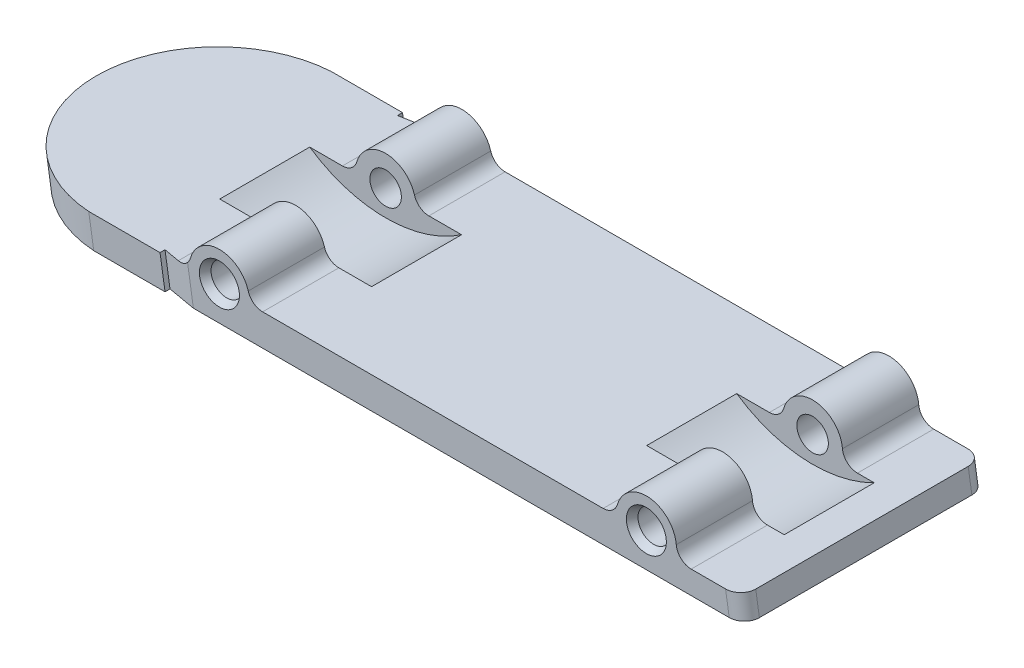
ISO-10303-21;
HEADER;
FILE_DESCRIPTION(('STEP AP214'),'2;1');
FILE_NAME('part.step','',(''),(''),'','','');
FILE_SCHEMA(('AUTOMOTIVE_DESIGN { 1 0 10303 214 1 1 1 1 }'));
ENDSEC;
DATA;
#1=APPLICATION_CONTEXT('core data for automotive mechanical design processes');
#2=APPLICATION_PROTOCOL_DEFINITION('international standard','automotive_design',2000,#1);
#3=PRODUCT_CONTEXT('',#1,'mechanical');
#4=PRODUCT('Part','Part','',(#3));
#5=PRODUCT_RELATED_PRODUCT_CATEGORY('part','',(#4));
#6=PRODUCT_DEFINITION_FORMATION('','',#4);
#7=PRODUCT_DEFINITION_CONTEXT('part definition',#1,'design');
#8=PRODUCT_DEFINITION('design','',#6,#7);
#9=PRODUCT_DEFINITION_SHAPE('','',#8);
#10=(LENGTH_UNIT() NAMED_UNIT(*) SI_UNIT(.MILLI.,.METRE.));
#11=(NAMED_UNIT(*) PLANE_ANGLE_UNIT() SI_UNIT($,.RADIAN.));
#12=(NAMED_UNIT(*) SI_UNIT($,.STERADIAN.) SOLID_ANGLE_UNIT());
#13=UNCERTAINTY_MEASURE_WITH_UNIT(LENGTH_MEASURE(1.E-05),#10,'distance_accuracy_value','');
#14=(GEOMETRIC_REPRESENTATION_CONTEXT(3) GLOBAL_UNCERTAINTY_ASSIGNED_CONTEXT((#13)) GLOBAL_UNIT_ASSIGNED_CONTEXT((#10,
#11,#12)) REPRESENTATION_CONTEXT('',''));
#15=CARTESIAN_POINT('',(0.,0.,0.));
#16=DIRECTION('',(0.,0.,1.));
#17=DIRECTION('',(1.,0.,0.));
#18=AXIS2_PLACEMENT_3D('',#15,#16,#17);
#19=CARTESIAN_POINT('',(37.8944125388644,1.04919693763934,0.762000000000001));
#20=DIRECTION('',(-0.156434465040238,0.987688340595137,0.));
#21=DIRECTION('',(-0.987688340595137,-0.156434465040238,0.));
#22=AXIS2_PLACEMENT_3D('',#19,#20,#21);
#23=CYLINDRICAL_SURFACE('',#22,0.762);
#24=DIRECTION('',(-0.156434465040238,0.987688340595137,0.));
#25=VECTOR('',#24,1.);
#26=CARTESIAN_POINT('',(38.6470310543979,1.1684,0.762000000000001));
#27=LINE('',#26,#25);
#28=CARTESIAN_POINT('',(38.8320874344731,0.,0.762000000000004));
#29=VERTEX_POINT('',#28);
#30=CARTESIAN_POINT('',(38.6470310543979,1.1684,0.762000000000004));
#31=VERTEX_POINT('',#30);
#32=EDGE_CURVE('E530',#29,#31,#27,.T.);
#33=ORIENTED_EDGE('',*,*,#32,.F.);
#34=CARTESIAN_POINT('',(38.0605890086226,0.,0.762000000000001));
#35=DIRECTION('',(0.,1.,0.));
#36=DIRECTION('',(-1.,0.,0.));
#37=AXIS2_PLACEMENT_3D('',#34,#35,#36);
#38=ELLIPSE('',#37,0.771498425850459,0.762);
#39=CARTESIAN_POINT('',(38.0605890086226,0.,0.));
#40=VERTEX_POINT('',#39);
#41=EDGE_CURVE('E39',#40,#29,#38,.F.);
#42=ORIENTED_EDGE('',*,*,#41,.F.);
#43=DIRECTION('',(-0.156434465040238,0.987688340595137,0.));
#44=VECTOR('',#43,1.);
#45=CARTESIAN_POINT('',(37.0080549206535,6.64543869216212,0.));
#46=LINE('',#45,#44);
#47=CARTESIAN_POINT('',(37.8755326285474,1.1684,0.));
#48=VERTEX_POINT('',#47);
#49=EDGE_CURVE('E533',#48,#40,#46,.F.);
#50=ORIENTED_EDGE('',*,*,#49,.F.);
#51=CARTESIAN_POINT('',(37.8755326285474,1.1684,0.762000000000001));
#52=DIRECTION('',(0.,-1.,0.));
#53=DIRECTION('',(-1.,0.,0.));
#54=AXIS2_PLACEMENT_3D('',#51,#52,#53);
#55=ELLIPSE('',#54,0.771498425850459,0.762);
#56=EDGE_CURVE('E11',#31,#48,#55,.F.);
#57=ORIENTED_EDGE('',*,*,#56,.F.);
#58=EDGE_LOOP('',(#33,#42,#50,#57));
#59=FACE_BOUND('',#58,.T.);
#60=ADVANCED_FACE('F32',(#59),#23,.T.);
#61=CARTESIAN_POINT('',(37.0080549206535,6.64543869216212,11.557));
#62=DIRECTION('',(0.156434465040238,-0.987688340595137,0.));
#63=DIRECTION('',(0.987688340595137,0.156434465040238,0.));
#64=AXIS2_PLACEMENT_3D('',#61,#62,#63);
#65=CYLINDRICAL_SURFACE('',#64,0.762);
#66=DIRECTION('',(-0.156434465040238,0.987688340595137,0.));
#67=VECTOR('',#66,1.);
#68=CARTESIAN_POINT('',(37.0080549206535,6.64543869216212,12.319));
#69=LINE('',#68,#67);
#70=CARTESIAN_POINT('',(38.0605890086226,0.,12.319));
#71=VERTEX_POINT('',#70);
#72=CARTESIAN_POINT('',(37.8755326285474,1.1684,12.319));
#73=VERTEX_POINT('',#72);
#74=EDGE_CURVE('E414',#71,#73,#69,.T.);
#75=ORIENTED_EDGE('',*,*,#74,.F.);
#76=CARTESIAN_POINT('',(38.0605890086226,0.,11.557));
#77=DIRECTION('',(0.,1.,0.));
#78=DIRECTION('',(1.,0.,0.));
#79=AXIS2_PLACEMENT_3D('',#76,#77,#78);
#80=ELLIPSE('',#79,0.771498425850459,0.762);
#81=CARTESIAN_POINT('',(38.8320874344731,0.,11.557));
#82=VERTEX_POINT('',#81);
#83=EDGE_CURVE('E417',#82,#71,#80,.F.);
#84=ORIENTED_EDGE('',*,*,#83,.F.);
#85=DIRECTION('',(-0.156434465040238,0.987688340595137,0.));
#86=VECTOR('',#85,1.);
#87=CARTESIAN_POINT('',(37.760673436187,6.76464175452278,11.557));
#88=LINE('',#87,#86);
#89=CARTESIAN_POINT('',(38.6470310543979,1.1684,11.557));
#90=VERTEX_POINT('',#89);
#91=EDGE_CURVE('E422',#90,#82,#88,.F.);
#92=ORIENTED_EDGE('',*,*,#91,.F.);
#93=CARTESIAN_POINT('',(37.8755326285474,1.1684,11.557));
#94=DIRECTION('',(0.,-1.,0.));
#95=DIRECTION('',(1.,0.,0.));
#96=AXIS2_PLACEMENT_3D('',#93,#94,#95);
#97=ELLIPSE('',#96,0.771498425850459,0.762);
#98=EDGE_CURVE('E419',#73,#90,#97,.F.);
#99=ORIENTED_EDGE('',*,*,#98,.F.);
#100=EDGE_LOOP('',(#75,#84,#92,#99));
#101=FACE_BOUND('',#100,.T.);
#102=ADVANCED_FACE('F403',(#101),#65,.T.);
#103=CARTESIAN_POINT('',(14.3568207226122,1.6002,12.319));
#104=DIRECTION('',(0.,-1.,0.));
#105=DIRECTION('',(1.,0.,0.));
#106=AXIS2_PLACEMENT_3D('',#103,#104,#105);
#107=PLANE('',#106);
#108=DIRECTION('',(-1.,0.,0.));
#109=VECTOR('',#108,1.);
#110=CARTESIAN_POINT('',(14.3568207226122,1.6002,3.8735));
#111=LINE('',#110,#109);
#112=CARTESIAN_POINT('',(31.6563501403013,1.6002,3.8735));
#113=VERTEX_POINT('',#112);
#114=CARTESIAN_POINT('',(29.9957047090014,1.6002,3.8735));
#115=VERTEX_POINT('',#114);
#116=EDGE_CURVE('E249',#113,#115,#111,.T.);
#117=ORIENTED_EDGE('',*,*,#116,.F.);
#118=DIRECTION('',(0.,0.,-1.));
#119=VECTOR('',#118,1.);
#120=CARTESIAN_POINT('',(31.6563501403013,1.6002,12.319));
#121=LINE('',#120,#119);
#122=CARTESIAN_POINT('',(31.6563501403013,1.6002,0.));
#123=VERTEX_POINT('',#122);
#124=EDGE_CURVE('E461',#113,#123,#121,.T.);
#125=ORIENTED_EDGE('',*,*,#124,.T.);
#126=DIRECTION('',(-1.,0.,0.));
#127=VECTOR('',#126,1.);
#128=CARTESIAN_POINT('',(14.3568207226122,1.6002,0.));
#129=LINE('',#128,#127);
#130=CARTESIAN_POINT('',(14.3568207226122,1.6002,0.));
#131=VERTEX_POINT('',#130);
#132=EDGE_CURVE('E572',#123,#131,#129,.T.);
#133=ORIENTED_EDGE('',*,*,#132,.T.);
#134=DIRECTION('',(0.,0.,-1.));
#135=VECTOR('',#134,1.);
#136=CARTESIAN_POINT('',(14.3568207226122,1.6002,12.319));
#137=LINE('',#136,#135);
#138=CARTESIAN_POINT('',(14.3568207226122,1.6002,3.8735));
#139=VERTEX_POINT('',#138);
#140=EDGE_CURVE('E457',#139,#131,#137,.T.);
#141=ORIENTED_EDGE('',*,*,#140,.F.);
#142=DIRECTION('',(-1.,0.,0.));
#143=VECTOR('',#142,1.);
#144=CARTESIAN_POINT('',(14.3568207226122,1.6002,3.8735));
#145=LINE('',#144,#143);
#146=CARTESIAN_POINT('',(16.0174661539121,1.6002,3.8735));
#147=VERTEX_POINT('',#146);
#148=EDGE_CURVE('E310',#147,#139,#145,.T.);
#149=ORIENTED_EDGE('',*,*,#148,.F.);
#150=DIRECTION('',(0.,0.,1.));
#151=VECTOR('',#150,1.);
#152=CARTESIAN_POINT('',(16.0174661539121,1.6002,3.8735));
#153=LINE('',#152,#151);
#154=CARTESIAN_POINT('',(16.0174661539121,1.6002,8.4455));
#155=VERTEX_POINT('',#154);
#156=EDGE_CURVE('E312',#147,#155,#153,.T.);
#157=ORIENTED_EDGE('',*,*,#156,.T.);
#158=DIRECTION('',(-1.,0.,0.));
#159=VECTOR('',#158,1.);
#160=CARTESIAN_POINT('',(14.3568207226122,1.6002,8.4455));
#161=LINE('',#160,#159);
#162=CARTESIAN_POINT('',(14.3568207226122,1.6002,8.4455));
#163=VERTEX_POINT('',#162);
#164=EDGE_CURVE('E298',#155,#163,#161,.T.);
#165=ORIENTED_EDGE('',*,*,#164,.T.);
#166=CARTESIAN_POINT('',(14.3568207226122,1.6002,12.319));
#167=VERTEX_POINT('',#166);
#168=EDGE_CURVE('E458',#167,#163,#137,.T.);
#169=ORIENTED_EDGE('',*,*,#168,.F.);
#170=DIRECTION('',(-1.,0.,0.));
#171=VECTOR('',#170,1.);
#172=CARTESIAN_POINT('',(14.3568207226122,1.6002,12.319));
#173=LINE('',#172,#171);
#174=CARTESIAN_POINT('',(31.6563501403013,1.6002,12.319));
#175=VERTEX_POINT('',#174);
#176=EDGE_CURVE('E548',#175,#167,#173,.T.);
#177=ORIENTED_EDGE('',*,*,#176,.F.);
#178=CARTESIAN_POINT('',(31.6563501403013,1.6002,8.4455));
#179=VERTEX_POINT('',#178);
#180=EDGE_CURVE('E262',#175,#179,#121,.T.);
#181=ORIENTED_EDGE('',*,*,#180,.T.);
#182=DIRECTION('',(-1.,0.,0.));
#183=VECTOR('',#182,1.);
#184=CARTESIAN_POINT('',(14.3568207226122,1.6002,8.4455));
#185=LINE('',#184,#183);
#186=CARTESIAN_POINT('',(29.9957047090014,1.6002,8.4455));
#187=VERTEX_POINT('',#186);
#188=EDGE_CURVE('E253',#179,#187,#185,.T.);
#189=ORIENTED_EDGE('',*,*,#188,.T.);
#190=DIRECTION('',(0.,0.,1.));
#191=VECTOR('',#190,1.);
#192=CARTESIAN_POINT('',(29.9957047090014,1.6002,3.8735));
#193=LINE('',#192,#191);
#194=EDGE_CURVE('E238',#187,#115,#193,.F.);
#195=ORIENTED_EDGE('',*,*,#194,.T.);
#196=EDGE_LOOP('',(#117,#125,#133,#141,#149,#157,#165,#169,#177,#181,#189,#195));
#197=FACE_BOUND('',#196,.T.);
#198=ADVANCED_FACE('F259',(#197),#107,.F.);
#199=CARTESIAN_POINT('',(36.1293364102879,1.1684,12.319));
#200=DIRECTION('',(0.,-1.,0.));
#201=DIRECTION('',(0.,0.,-1.));
#202=AXIS2_PLACEMENT_3D('',#199,#200,#201);
#203=PLANE('',#202);
#204=DIRECTION('',(0.,0.,-1.));
#205=VECTOR('',#204,1.);
#206=CARTESIAN_POINT('',(38.6470310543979,1.1684,12.319));
#207=LINE('',#206,#205);
#208=EDGE_CURVE('E475',#90,#31,#207,.T.);
#209=ORIENTED_EDGE('',*,*,#208,.T.);
#210=ORIENTED_EDGE('',*,*,#56,.T.);
#211=DIRECTION('',(-1.,0.,0.));
#212=VECTOR('',#211,1.);
#213=CARTESIAN_POINT('',(36.1293364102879,1.1684,0.));
#214=LINE('',#213,#212);
#215=CARTESIAN_POINT('',(36.1293364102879,1.1684,0.));
#216=VERTEX_POINT('',#215);
#217=EDGE_CURVE('E561',#48,#216,#214,.T.);
#218=ORIENTED_EDGE('',*,*,#217,.T.);
#219=DIRECTION('',(0.,0.,-1.));
#220=VECTOR('',#219,1.);
#221=CARTESIAN_POINT('',(36.1293364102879,1.1684,12.319));
#222=LINE('',#221,#220);
#223=CARTESIAN_POINT('',(36.1293364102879,1.1684,3.8735));
#224=VERTEX_POINT('',#223);
#225=EDGE_CURVE('E471',#224,#216,#222,.T.);
#226=ORIENTED_EDGE('',*,*,#225,.F.);
#227=DIRECTION('',(-1.,0.,0.));
#228=VECTOR('',#227,1.);
#229=CARTESIAN_POINT('',(36.1293364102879,1.1684,3.8735));
#230=LINE('',#229,#228);
#231=CARTESIAN_POINT('',(36.9813175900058,1.1684,3.8735));
#232=VERTEX_POINT('',#231);
#233=EDGE_CURVE('E277',#232,#224,#230,.T.);
#234=ORIENTED_EDGE('',*,*,#233,.F.);
#235=DIRECTION('',(0.,0.,1.));
#236=VECTOR('',#235,1.);
#237=CARTESIAN_POINT('',(36.9813175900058,1.1684,3.8735));
#238=LINE('',#237,#236);
#239=CARTESIAN_POINT('',(36.9813175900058,1.1684,8.4455));
#240=VERTEX_POINT('',#239);
#241=EDGE_CURVE('E498',#232,#240,#238,.T.);
#242=ORIENTED_EDGE('',*,*,#241,.T.);
#243=DIRECTION('',(-1.,0.,0.));
#244=VECTOR('',#243,1.);
#245=CARTESIAN_POINT('',(36.1293364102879,1.1684,8.4455));
#246=LINE('',#245,#244);
#247=CARTESIAN_POINT('',(36.1293364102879,1.1684,8.4455));
#248=VERTEX_POINT('',#247);
#249=EDGE_CURVE('E256',#240,#248,#246,.T.);
#250=ORIENTED_EDGE('',*,*,#249,.T.);
#251=CARTESIAN_POINT('',(36.1293364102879,1.1684,12.319));
#252=VERTEX_POINT('',#251);
#253=EDGE_CURVE('E472',#252,#248,#222,.T.);
#254=ORIENTED_EDGE('',*,*,#253,.F.);
#255=DIRECTION('',(-1.,0.,0.));
#256=VECTOR('',#255,1.);
#257=CARTESIAN_POINT('',(36.1293364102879,1.1684,12.319));
#258=LINE('',#257,#256);
#259=EDGE_CURVE('E432',#73,#252,#258,.T.);
#260=ORIENTED_EDGE('',*,*,#259,.F.);
#261=ORIENTED_EDGE('',*,*,#98,.T.);
#262=EDGE_LOOP('',(#209,#210,#218,#226,#234,#242,#250,#254,#260,#261));
#263=FACE_BOUND('',#262,.T.);
#264=ADVANCED_FACE('F410',(#263),#203,.F.);
#265=CARTESIAN_POINT('',(36.1293364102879,1.9304,12.319));
#266=DIRECTION('',(0.,0.,-1.));
#267=DIRECTION('',(-1.,0.,0.));
#268=AXIS2_PLACEMENT_3D('',#265,#266,#267);
#269=CYLINDRICAL_SURFACE('',#268,0.761999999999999);
#270=CARTESIAN_POINT('',(36.1293364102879,1.9304,3.8735));
#271=DIRECTION('',(0.,0.,1.));
#272=DIRECTION('',(1.,0.,0.));
#273=AXIS2_PLACEMENT_3D('',#270,#271,#272);
#274=CIRCLE('',#273,0.761999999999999);
#275=CARTESIAN_POINT('',(35.3703527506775,1.86266666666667,3.8735));
#276=VERTEX_POINT('',#275);
#277=EDGE_CURVE('E275',#224,#276,#274,.F.);
#278=ORIENTED_EDGE('',*,*,#277,.F.);
#279=ORIENTED_EDGE('',*,*,#225,.T.);
#280=CARTESIAN_POINT('',(36.1293364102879,1.9304,0.));
#281=DIRECTION('',(0.,0.,-1.));
#282=DIRECTION('',(-1.,0.,0.));
#283=AXIS2_PLACEMENT_3D('',#280,#281,#282);
#284=CIRCLE('',#283,0.761999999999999);
#285=CARTESIAN_POINT('',(35.3703527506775,1.86266666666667,0.));
#286=VERTEX_POINT('',#285);
#287=EDGE_CURVE('E563',#216,#286,#284,.T.);
#288=ORIENTED_EDGE('',*,*,#287,.T.);
#289=DIRECTION('',(0.,0.,-1.));
#290=VECTOR('',#289,1.);
#291=CARTESIAN_POINT('',(35.3703527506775,1.86266666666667,12.319));
#292=LINE('',#291,#290);
#293=EDGE_CURVE('E467',#276,#286,#292,.T.);
#294=ORIENTED_EDGE('',*,*,#293,.F.);
#295=EDGE_LOOP('',(#278,#279,#288,#294));
#296=FACE_BOUND('',#295,.T.);
#297=ADVANCED_FACE('F623',(#296),#269,.F.);
#298=CARTESIAN_POINT('',(33.8523854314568,1.7272,12.319));
#299=DIRECTION('',(0.,0.,-1.));
#300=DIRECTION('',(-1.,0.,0.));
#301=AXIS2_PLACEMENT_3D('',#298,#299,#300);
#302=CYLINDRICAL_SURFACE('',#301,1.524);
#303=CARTESIAN_POINT('',(33.8523854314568,1.7272,3.8735));
#304=DIRECTION('',(0.,0.,1.));
#305=DIRECTION('',(1.,0.,0.));
#306=AXIS2_PLACEMENT_3D('',#303,#304,#305);
#307=CIRCLE('',#306,1.524);
#308=CARTESIAN_POINT('',(32.3883619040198,2.15053333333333,3.8735));
#309=VERTEX_POINT('',#308);
#310=EDGE_CURVE('E273',#276,#309,#307,.T.);
#311=ORIENTED_EDGE('',*,*,#310,.F.);
#312=ORIENTED_EDGE('',*,*,#293,.T.);
#313=CARTESIAN_POINT('',(33.8523854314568,1.7272,0.));
#314=DIRECTION('',(0.,0.,1.));
#315=DIRECTION('',(-1.,0.,0.));
#316=AXIS2_PLACEMENT_3D('',#313,#314,#315);
#317=CIRCLE('',#316,1.524);
#318=CARTESIAN_POINT('',(32.3883619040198,2.15053333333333,0.));
#319=VERTEX_POINT('',#318);
#320=EDGE_CURVE('E566',#286,#319,#317,.T.);
#321=ORIENTED_EDGE('',*,*,#320,.T.);
#322=DIRECTION('',(0.,0.,-1.));
#323=VECTOR('',#322,1.);
#324=CARTESIAN_POINT('',(32.3883619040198,2.15053333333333,12.319));
#325=LINE('',#324,#323);
#326=EDGE_CURVE('E463',#309,#319,#325,.T.);
#327=ORIENTED_EDGE('',*,*,#326,.F.);
#328=EDGE_LOOP('',(#311,#312,#321,#327));
#329=FACE_BOUND('',#328,.T.);
#330=ADVANCED_FACE('F618',(#329),#302,.T.);
#331=CARTESIAN_POINT('',(31.6563501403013,2.3622,12.319));
#332=DIRECTION('',(0.,0.,-1.));
#333=DIRECTION('',(-1.,0.,0.));
#334=AXIS2_PLACEMENT_3D('',#331,#332,#333);
#335=CYLINDRICAL_SURFACE('',#334,0.762);
#336=CARTESIAN_POINT('',(31.6563501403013,2.3622,3.8735));
#337=DIRECTION('',(0.,0.,1.));
#338=DIRECTION('',(1.,0.,0.));
#339=AXIS2_PLACEMENT_3D('',#336,#337,#338);
#340=CIRCLE('',#339,0.762);
#341=EDGE_CURVE('E266',#309,#113,#340,.F.);
#342=ORIENTED_EDGE('',*,*,#341,.F.);
#343=ORIENTED_EDGE('',*,*,#326,.T.);
#344=CARTESIAN_POINT('',(31.6563501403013,2.3622,0.));
#345=DIRECTION('',(0.,0.,-1.));
#346=DIRECTION('',(-1.,0.,0.));
#347=AXIS2_PLACEMENT_3D('',#344,#345,#346);
#348=CIRCLE('',#347,0.762);
#349=EDGE_CURVE('E569',#319,#123,#348,.T.);
#350=ORIENTED_EDGE('',*,*,#349,.T.);
#351=ORIENTED_EDGE('',*,*,#124,.F.);
#352=EDGE_LOOP('',(#342,#343,#350,#351));
#353=FACE_BOUND('',#352,.T.);
#354=ADVANCED_FACE('F614',(#353),#335,.F.);
#355=CARTESIAN_POINT('',(33.8523854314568,1.7272,12.319));
#356=DIRECTION('',(0.,0.,-1.));
#357=DIRECTION('',(-1.,0.,0.));
#358=AXIS2_PLACEMENT_3D('',#355,#356,#357);
#359=CYLINDRICAL_SURFACE('',#358,0.8001);
#360=CARTESIAN_POINT('',(33.8523854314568,1.7272,0.215899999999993));
#361=DIRECTION('',(0.,0.,1.));
#362=DIRECTION('',(1.,0.,0.));
#363=AXIS2_PLACEMENT_3D('',#360,#361,#362);
#364=CIRCLE('',#363,0.8001);
#365=CARTESIAN_POINT('',(33.0522854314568,1.7272,0.215899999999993));
#366=VERTEX_POINT('',#365);
#367=EDGE_CURVE('E510',#366,#366,#364,.F.);
#368=CARTESIAN_POINT('',(33.8523854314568,1.7272,3.8735));
#369=DIRECTION('',(0.,0.,1.));
#370=DIRECTION('',(1.,0.,0.));
#371=AXIS2_PLACEMENT_3D('',#368,#369,#370);
#372=CIRCLE('',#371,0.8001);
#373=CARTESIAN_POINT('',(33.0522854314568,1.7272,3.8735));
#374=VERTEX_POINT('',#373);
#375=EDGE_CURVE('E263',#374,#374,#372,.T.);
#376=CARTESIAN_POINT('',(33.0522854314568,1.7272,0.215899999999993));
#377=CARTESIAN_POINT('',(33.0522854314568,1.7272,0.253999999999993));
#378=CARTESIAN_POINT('',(33.0522854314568,1.7272,0.292099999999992));
#379=CARTESIAN_POINT('',(33.0522854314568,1.7272,0.368299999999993));
#380=CARTESIAN_POINT('',(33.0522854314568,1.7272,0.406399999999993));
#381=CARTESIAN_POINT('',(33.0522854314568,1.7272,0.482599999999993));
#382=CARTESIAN_POINT('',(33.0522854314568,1.7272,0.520699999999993));
#383=CARTESIAN_POINT('',(33.0522854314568,1.7272,0.596899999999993));
#384=CARTESIAN_POINT('',(33.0522854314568,1.7272,0.634999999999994));
#385=CARTESIAN_POINT('',(33.0522854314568,1.7272,0.711199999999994));
#386=CARTESIAN_POINT('',(33.0522854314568,1.7272,0.749299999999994));
#387=CARTESIAN_POINT('',(33.0522854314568,1.7272,0.825499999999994));
#388=CARTESIAN_POINT('',(33.0522854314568,1.7272,0.863599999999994));
#389=CARTESIAN_POINT('',(33.0522854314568,1.7272,0.939799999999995));
#390=CARTESIAN_POINT('',(33.0522854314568,1.7272,0.977899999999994));
#391=CARTESIAN_POINT('',(33.0522854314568,1.7272,1.05409999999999));
#392=CARTESIAN_POINT('',(33.0522854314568,1.7272,1.0922));
#393=CARTESIAN_POINT('',(33.0522854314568,1.7272,1.1684));
#394=CARTESIAN_POINT('',(33.0522854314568,1.7272,1.2065));
#395=CARTESIAN_POINT('',(33.0522854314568,1.7272,1.28269999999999));
#396=CARTESIAN_POINT('',(33.0522854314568,1.7272,1.32079999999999));
#397=CARTESIAN_POINT('',(33.0522854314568,1.7272,1.39699999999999));
#398=CARTESIAN_POINT('',(33.0522854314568,1.7272,1.4351));
#399=CARTESIAN_POINT('',(33.0522854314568,1.7272,1.5113));
#400=CARTESIAN_POINT('',(33.0522854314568,1.7272,1.5494));
#401=CARTESIAN_POINT('',(33.0522854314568,1.7272,1.6256));
#402=CARTESIAN_POINT('',(33.0522854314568,1.7272,1.6637));
#403=CARTESIAN_POINT('',(33.0522854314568,1.7272,1.7399));
#404=CARTESIAN_POINT('',(33.0522854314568,1.7272,1.778));
#405=CARTESIAN_POINT('',(33.0522854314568,1.7272,1.8542));
#406=CARTESIAN_POINT('',(33.0522854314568,1.7272,1.8923));
#407=CARTESIAN_POINT('',(33.0522854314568,1.7272,1.9685));
#408=CARTESIAN_POINT('',(33.0522854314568,1.7272,2.0066));
#409=CARTESIAN_POINT('',(33.0522854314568,1.7272,2.0828));
#410=CARTESIAN_POINT('',(33.0522854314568,1.7272,2.1209));
#411=CARTESIAN_POINT('',(33.0522854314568,1.7272,2.1971));
#412=CARTESIAN_POINT('',(33.0522854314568,1.7272,2.2352));
#413=CARTESIAN_POINT('',(33.0522854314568,1.7272,2.3114));
#414=CARTESIAN_POINT('',(33.0522854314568,1.7272,2.3495));
#415=CARTESIAN_POINT('',(33.0522854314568,1.7272,2.4257));
#416=CARTESIAN_POINT('',(33.0522854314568,1.7272,2.4638));
#417=CARTESIAN_POINT('',(33.0522854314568,1.7272,2.54));
#418=CARTESIAN_POINT('',(33.0522854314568,1.7272,2.5781));
#419=CARTESIAN_POINT('',(33.0522854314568,1.7272,2.6543));
#420=CARTESIAN_POINT('',(33.0522854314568,1.7272,2.6924));
#421=CARTESIAN_POINT('',(33.0522854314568,1.7272,2.7686));
#422=CARTESIAN_POINT('',(33.0522854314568,1.7272,2.8067));
#423=CARTESIAN_POINT('',(33.0522854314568,1.7272,2.8829));
#424=CARTESIAN_POINT('',(33.0522854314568,1.7272,2.921));
#425=CARTESIAN_POINT('',(33.0522854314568,1.7272,2.9972));
#426=CARTESIAN_POINT('',(33.0522854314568,1.7272,3.0353));
#427=CARTESIAN_POINT('',(33.0522854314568,1.7272,3.1115));
#428=CARTESIAN_POINT('',(33.0522854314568,1.7272,3.1496));
#429=CARTESIAN_POINT('',(33.0522854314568,1.7272,3.2258));
#430=CARTESIAN_POINT('',(33.0522854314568,1.7272,3.2639));
#431=CARTESIAN_POINT('',(33.0522854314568,1.7272,3.3401));
#432=CARTESIAN_POINT('',(33.0522854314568,1.7272,3.3782));
#433=CARTESIAN_POINT('',(33.0522854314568,1.7272,3.4544));
#434=CARTESIAN_POINT('',(33.0522854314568,1.7272,3.4925));
#435=CARTESIAN_POINT('',(33.0522854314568,1.7272,3.5687));
#436=CARTESIAN_POINT('',(33.0522854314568,1.7272,3.6068));
#437=CARTESIAN_POINT('',(33.0522854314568,1.7272,3.683));
#438=CARTESIAN_POINT('',(33.0522854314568,1.7272,3.7211));
#439=CARTESIAN_POINT('',(33.0522854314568,1.7272,3.7973));
#440=CARTESIAN_POINT('',(33.0522854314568,1.7272,3.8354));
#441=CARTESIAN_POINT('',(33.0522854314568,1.7272,3.8735));
#442=B_SPLINE_CURVE_WITH_KNOTS('',3,(#376,#377,#378,#379,#380,#381,#382,#383,#384,#385,#386,
#387,#388,#389,#390,#391,#392,#393,#394,#395,#396,#397,#398,#399,#400,#401,#402,#403,#404,#405,
#406,#407,#408,#409,#410,#411,#412,#413,#414,#415,#416,#417,#418,#419,#420,#421,#422,#423,#424,
#425,#426,#427,#428,#429,#430,#431,#432,#433,#434,#435,#436,#437,#438,#439,#440,#441),
.UNSPECIFIED.,.F.,.F.,(4,2,2,2,2,2,2,2,2,2,2,2,2,2,2,2,2,2,2,2,2,2,2,2,2,2,2,2,2,2,2,2,4),(0.,
0.114299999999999,0.228600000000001,0.3429,0.457200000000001,0.571500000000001,
0.685800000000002,0.800100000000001,0.914400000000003,1.0287,1.143,1.2573,1.3716,1.4859,1.6002,
1.7145,1.8288,1.9431,2.0574,2.1717,2.286,2.4003,2.51460000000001,2.62890000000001,2.7432,
2.85750000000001,2.97180000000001,3.08610000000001,3.20040000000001,3.31470000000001,
3.42900000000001,3.54330000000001,3.65760000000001),.UNSPECIFIED.);
#443=EDGE_CURVE('BSEAM704',#366,#374,#442,.T.);
#444=ORIENTED_EDGE('',*,*,#367,.T.);
#445=ORIENTED_EDGE('',*,*,#375,.T.);
#446=ORIENTED_EDGE('',*,*,#443,.T.);
#447=ORIENTED_EDGE('',*,*,#443,.F.);
#448=EDGE_LOOP('',(#444,#446,#445,#447));
#449=FACE_BOUND('',#448,.T.);
#450=ADVANCED_FACE('F704',(#449),#359,.F.);
#451=CARTESIAN_POINT('',(14.3568207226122,2.3622,12.319));
#452=DIRECTION('',(0.,0.,-1.));
#453=DIRECTION('',(-1.,0.,0.));
#454=AXIS2_PLACEMENT_3D('',#451,#452,#453);
#455=CYLINDRICAL_SURFACE('',#454,0.762);
#456=CARTESIAN_POINT('',(14.3568207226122,2.3622,3.8735));
#457=DIRECTION('',(0.,0.,1.));
#458=DIRECTION('',(1.,0.,0.));
#459=AXIS2_PLACEMENT_3D('',#456,#457,#458);
#460=CIRCLE('',#459,0.762);
#461=CARTESIAN_POINT('',(13.6248089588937,2.15053333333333,3.8735));
#462=VERTEX_POINT('',#461);
#463=EDGE_CURVE('E308',#139,#462,#460,.F.);
#464=ORIENTED_EDGE('',*,*,#463,.F.);
#465=ORIENTED_EDGE('',*,*,#140,.T.);
#466=CARTESIAN_POINT('',(14.3568207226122,2.3622,0.));
#467=DIRECTION('',(0.,0.,-1.));
#468=DIRECTION('',(-1.,0.,0.));
#469=AXIS2_PLACEMENT_3D('',#466,#467,#468);
#470=CIRCLE('',#469,0.762);
#471=CARTESIAN_POINT('',(13.6248089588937,2.15053333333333,0.));
#472=VERTEX_POINT('',#471);
#473=EDGE_CURVE('E575',#131,#472,#470,.T.);
#474=ORIENTED_EDGE('',*,*,#473,.T.);
#475=DIRECTION('',(0.,0.,-1.));
#476=VECTOR('',#475,1.);
#477=CARTESIAN_POINT('',(13.6248089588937,2.15053333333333,12.319));
#478=LINE('',#477,#476);
#479=EDGE_CURVE('E453',#462,#472,#478,.T.);
#480=ORIENTED_EDGE('',*,*,#479,.F.);
#481=EDGE_LOOP('',(#464,#465,#474,#480));
#482=FACE_BOUND('',#481,.T.);
#483=ADVANCED_FACE('F607',(#482),#455,.F.);
#484=CARTESIAN_POINT('',(12.1607854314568,1.7272,12.319));
#485=DIRECTION('',(0.,0.,-1.));
#486=DIRECTION('',(-1.,0.,0.));
#487=AXIS2_PLACEMENT_3D('',#484,#485,#486);
#488=CYLINDRICAL_SURFACE('',#487,1.524);
#489=CARTESIAN_POINT('',(12.1607854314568,1.7272,3.8735));
#490=DIRECTION('',(0.,0.,1.));
#491=DIRECTION('',(1.,0.,0.));
#492=AXIS2_PLACEMENT_3D('',#489,#490,#491);
#493=CIRCLE('',#492,1.524);
#494=CARTESIAN_POINT('',(10.6967619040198,2.15053333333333,3.8735));
#495=VERTEX_POINT('',#494);
#496=EDGE_CURVE('E306',#462,#495,#493,.T.);
#497=ORIENTED_EDGE('',*,*,#496,.F.);
#498=ORIENTED_EDGE('',*,*,#479,.T.);
#499=CARTESIAN_POINT('',(12.1607854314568,1.7272,0.));
#500=DIRECTION('',(0.,0.,1.));
#501=DIRECTION('',(-1.,0.,0.));
#502=AXIS2_PLACEMENT_3D('',#499,#500,#501);
#503=CIRCLE('',#502,1.524);
#504=CARTESIAN_POINT('',(10.6967619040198,2.15053333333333,0.));
#505=VERTEX_POINT('',#504);
#506=EDGE_CURVE('E441',#472,#505,#503,.T.);
#507=ORIENTED_EDGE('',*,*,#506,.T.);
#508=DIRECTION('',(0.,0.,-1.));
#509=VECTOR('',#508,1.);
#510=CARTESIAN_POINT('',(10.6967619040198,2.15053333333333,12.319));
#511=LINE('',#510,#509);
#512=EDGE_CURVE('E448',#495,#505,#511,.T.);
#513=ORIENTED_EDGE('',*,*,#512,.F.);
#514=EDGE_LOOP('',(#497,#498,#507,#513));
#515=FACE_BOUND('',#514,.T.);
#516=ADVANCED_FACE('F583',(#515),#488,.T.);
#517=CARTESIAN_POINT('',(9.96475014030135,2.3622,12.319));
#518=DIRECTION('',(0.,0.,-1.));
#519=DIRECTION('',(-1.,0.,0.));
#520=AXIS2_PLACEMENT_3D('',#517,#518,#519);
#521=CYLINDRICAL_SURFACE('',#520,0.762);
#522=CARTESIAN_POINT('',(9.96475014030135,2.3622,3.8735));
#523=DIRECTION('',(0.,0.,1.));
#524=DIRECTION('',(1.,0.,0.));
#525=AXIS2_PLACEMENT_3D('',#522,#523,#524);
#526=CIRCLE('',#525,0.762);
#527=CARTESIAN_POINT('',(9.96475014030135,1.6002,3.8735));
#528=VERTEX_POINT('',#527);
#529=EDGE_CURVE('E304',#495,#528,#526,.F.);
#530=ORIENTED_EDGE('',*,*,#529,.F.);
#531=ORIENTED_EDGE('',*,*,#512,.T.);
#532=CARTESIAN_POINT('',(9.96475014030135,2.3622,0.));
#533=DIRECTION('',(0.,0.,-1.));
#534=DIRECTION('',(1.,0.,0.));
#535=AXIS2_PLACEMENT_3D('',#532,#533,#534);
#536=CIRCLE('',#535,0.762);
#537=CARTESIAN_POINT('',(10.5429740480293,1.86591267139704,0.));
#538=VERTEX_POINT('',#537);
#539=EDGE_CURVE('E433',#505,#538,#536,.T.);
#540=ORIENTED_EDGE('',*,*,#539,.T.);
#541=CARTESIAN_POINT('',(9.96475014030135,2.3622,0.0880964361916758));
#542=DIRECTION('',(0.173582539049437,0.027492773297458,0.984435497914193));
#543=DIRECTION('',(0.972315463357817,0.153999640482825,-0.17574626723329));
#544=AXIS2_PLACEMENT_3D('',#541,#542,#543);
#545=ELLIPSE('',#544,0.774047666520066,0.762);
#546=CARTESIAN_POINT('',(9.96475014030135,1.6002,0.109377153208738));
#547=VERTEX_POINT('',#546);
#548=EDGE_CURVE('E343',#538,#547,#545,.F.);
#549=ORIENTED_EDGE('',*,*,#548,.T.);
#550=DIRECTION('',(0.,0.,-1.));
#551=VECTOR('',#550,1.);
#552=CARTESIAN_POINT('',(9.96475014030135,1.6002,12.319));
#553=LINE('',#552,#551);
#554=EDGE_CURVE('E449',#528,#547,#553,.T.);
#555=ORIENTED_EDGE('',*,*,#554,.F.);
#556=EDGE_LOOP('',(#530,#531,#540,#549,#555));
#557=FACE_BOUND('',#556,.T.);
#558=ADVANCED_FACE('F591',(#557),#521,.F.);
#559=CARTESIAN_POINT('',(-0.25344678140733,1.60019999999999,12.319));
#560=DIRECTION('',(0.,-1.,0.));
#561=DIRECTION('',(1.,0.,0.));
#562=AXIS2_PLACEMENT_3D('',#559,#560,#561);
#563=PLANE('',#562);
#564=DIRECTION('',(-1.,0.,0.));
#565=VECTOR('',#564,1.);
#566=CARTESIAN_POINT('',(-0.25344678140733,1.60019999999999,3.8735));
#567=LINE('',#566,#565);
#568=CARTESIAN_POINT('',(8.30410470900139,1.60019999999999,3.8735));
#569=VERTEX_POINT('',#568);
#570=EDGE_CURVE('E302',#528,#569,#567,.T.);
#571=ORIENTED_EDGE('',*,*,#570,.F.);
#572=ORIENTED_EDGE('',*,*,#554,.T.);
#573=DIRECTION('',(-0.984807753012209,0.,0.173648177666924));
#574=VECTOR('',#573,1.);
#575=CARTESIAN_POINT('',(-2.03329892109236,1.60019999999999,2.22495691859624));
#576=LINE('',#575,#574);
#577=CARTESIAN_POINT('',(9.14455321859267,1.6002,0.254));
#578=VERTEX_POINT('',#577);
#579=EDGE_CURVE('E482',#547,#578,#576,.T.);
#580=ORIENTED_EDGE('',*,*,#579,.T.);
#581=DIRECTION('',(0.,0.,-1.));
#582=VECTOR('',#581,1.);
#583=CARTESIAN_POINT('',(9.14455321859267,1.6002,12.319));
#584=LINE('',#583,#582);
#585=CARTESIAN_POINT('',(9.14455321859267,1.6002,0.));
#586=VERTEX_POINT('',#585);
#587=EDGE_CURVE('E480',#578,#586,#584,.T.);
#588=ORIENTED_EDGE('',*,*,#587,.T.);
#589=DIRECTION('',(-1.,0.,0.));
#590=VECTOR('',#589,1.);
#591=CARTESIAN_POINT('',(-0.25344678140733,1.60019999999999,0.));
#592=LINE('',#591,#590);
#593=CARTESIAN_POINT('',(5.52301013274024,1.60019999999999,0.));
#594=VERTEX_POINT('',#593);
#595=EDGE_CURVE('E430',#586,#594,#592,.T.);
#596=ORIENTED_EDGE('',*,*,#595,.T.);
#597=CARTESIAN_POINT('',(5.91875321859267,1.60019999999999,6.1595));
#598=DIRECTION('',(0.,1.,0.));
#599=DIRECTION('',(-1.,0.,0.));
#600=AXIS2_PLACEMENT_3D('',#597,#598,#599);
#601=CIRCLE('',#600,6.1722);
#602=CARTESIAN_POINT('',(5.52301013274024,1.60019999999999,12.319));
#603=VERTEX_POINT('',#602);
#604=EDGE_CURVE('E352',#603,#594,#601,.F.);
#605=ORIENTED_EDGE('',*,*,#604,.F.);
#606=DIRECTION('',(-1.,0.,0.));
#607=VECTOR('',#606,1.);
#608=CARTESIAN_POINT('',(-0.25344678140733,1.60019999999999,12.319));
#609=LINE('',#608,#607);
#610=CARTESIAN_POINT('',(9.14455321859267,1.6002,12.319));
#611=VERTEX_POINT('',#610);
#612=EDGE_CURVE('E556',#611,#603,#609,.T.);
#613=ORIENTED_EDGE('',*,*,#612,.F.);
#614=DIRECTION('',(0.,0.,-1.));
#615=VECTOR('',#614,1.);
#616=CARTESIAN_POINT('',(9.14455321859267,1.6002,12.319));
#617=LINE('',#616,#615);
#618=CARTESIAN_POINT('',(9.14455321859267,1.6002,12.065));
#619=VERTEX_POINT('',#618);
#620=EDGE_CURVE('E488',#611,#619,#617,.T.);
#621=ORIENTED_EDGE('',*,*,#620,.T.);
#622=DIRECTION('',(0.984807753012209,0.,0.173648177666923));
#623=VECTOR('',#622,1.);
#624=CARTESIAN_POINT('',(0.0733741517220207,1.60019999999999,10.4655063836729));
#625=LINE('',#624,#623);
#626=CARTESIAN_POINT('',(9.96475014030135,1.6002,12.2096228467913));
#627=VERTEX_POINT('',#626);
#628=EDGE_CURVE('E485',#619,#627,#625,.T.);
#629=ORIENTED_EDGE('',*,*,#628,.T.);
#630=CARTESIAN_POINT('',(9.96475014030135,1.6002,8.4455));
#631=VERTEX_POINT('',#630);
#632=EDGE_CURVE('E445',#627,#631,#553,.T.);
#633=ORIENTED_EDGE('',*,*,#632,.T.);
#634=DIRECTION('',(-1.,0.,0.));
#635=VECTOR('',#634,1.);
#636=CARTESIAN_POINT('',(-0.25344678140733,1.60019999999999,8.4455));
#637=LINE('',#636,#635);
#638=CARTESIAN_POINT('',(8.30410470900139,1.60019999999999,8.4455));
#639=VERTEX_POINT('',#638);
#640=EDGE_CURVE('E286',#631,#639,#637,.T.);
#641=ORIENTED_EDGE('',*,*,#640,.T.);
#642=DIRECTION('',(0.,0.,1.));
#643=VECTOR('',#642,1.);
#644=CARTESIAN_POINT('',(8.30410470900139,1.6002,3.8735));
#645=LINE('',#644,#643);
#646=EDGE_CURVE('E491',#639,#569,#645,.F.);
#647=ORIENTED_EDGE('',*,*,#646,.T.);
#648=EDGE_LOOP('',(#571,#572,#580,#588,#596,#605,#613,#621,#629,#633,#641,#647));
#649=FACE_BOUND('',#648,.T.);
#650=ADVANCED_FACE('F597',(#649),#563,.F.);
#651=CARTESIAN_POINT('',(12.1607854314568,1.7272,12.319));
#652=DIRECTION('',(0.,0.,-1.));
#653=DIRECTION('',(-1.,0.,0.));
#654=AXIS2_PLACEMENT_3D('',#651,#652,#653);
#655=CYLINDRICAL_SURFACE('',#654,0.8001);
#656=CARTESIAN_POINT('',(12.1607854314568,1.7272,0.215899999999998));
#657=DIRECTION('',(0.,0.,1.));
#658=DIRECTION('',(1.,0.,0.));
#659=AXIS2_PLACEMENT_3D('',#656,#657,#658);
#660=CIRCLE('',#659,0.8001);
#661=CARTESIAN_POINT('',(11.3606854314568,1.7272,0.215899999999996));
#662=VERTEX_POINT('',#661);
#663=EDGE_CURVE('E513',#662,#662,#660,.F.);
#664=CARTESIAN_POINT('',(12.1607854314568,1.7272,3.8735));
#665=DIRECTION('',(0.,0.,1.));
#666=DIRECTION('',(1.,0.,0.));
#667=AXIS2_PLACEMENT_3D('',#664,#665,#666);
#668=CIRCLE('',#667,0.8001);
#669=CARTESIAN_POINT('',(11.3606854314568,1.7272,3.8735));
#670=VERTEX_POINT('',#669);
#671=EDGE_CURVE('E301',#670,#670,#668,.T.);
#672=CARTESIAN_POINT('',(11.3606854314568,1.7272,0.215899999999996));
#673=CARTESIAN_POINT('',(11.3606854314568,1.7272,0.253999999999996));
#674=CARTESIAN_POINT('',(11.3606854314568,1.7272,0.292099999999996));
#675=CARTESIAN_POINT('',(11.3606854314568,1.7272,0.368299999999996));
#676=CARTESIAN_POINT('',(11.3606854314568,1.7272,0.406399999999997));
#677=CARTESIAN_POINT('',(11.3606854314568,1.7272,0.482599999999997));
#678=CARTESIAN_POINT('',(11.3606854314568,1.7272,0.520699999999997));
#679=CARTESIAN_POINT('',(11.3606854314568,1.7272,0.596899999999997));
#680=CARTESIAN_POINT('',(11.3606854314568,1.7272,0.634999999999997));
#681=CARTESIAN_POINT('',(11.3606854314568,1.7272,0.711199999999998));
#682=CARTESIAN_POINT('',(11.3606854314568,1.7272,0.749299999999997));
#683=CARTESIAN_POINT('',(11.3606854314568,1.7272,0.825499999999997));
#684=CARTESIAN_POINT('',(11.3606854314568,1.7272,0.863599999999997));
#685=CARTESIAN_POINT('',(11.3606854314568,1.7272,0.939799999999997));
#686=CARTESIAN_POINT('',(11.3606854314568,1.7272,0.977899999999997));
#687=CARTESIAN_POINT('',(11.3606854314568,1.7272,1.0541));
#688=CARTESIAN_POINT('',(11.3606854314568,1.7272,1.0922));
#689=CARTESIAN_POINT('',(11.3606854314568,1.7272,1.1684));
#690=CARTESIAN_POINT('',(11.3606854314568,1.7272,1.2065));
#691=CARTESIAN_POINT('',(11.3606854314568,1.7272,1.2827));
#692=CARTESIAN_POINT('',(11.3606854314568,1.7272,1.3208));
#693=CARTESIAN_POINT('',(11.3606854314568,1.7272,1.397));
#694=CARTESIAN_POINT('',(11.3606854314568,1.7272,1.4351));
#695=CARTESIAN_POINT('',(11.3606854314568,1.7272,1.5113));
#696=CARTESIAN_POINT('',(11.3606854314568,1.7272,1.5494));
#697=CARTESIAN_POINT('',(11.3606854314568,1.7272,1.6256));
#698=CARTESIAN_POINT('',(11.3606854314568,1.7272,1.6637));
#699=CARTESIAN_POINT('',(11.3606854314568,1.7272,1.7399));
#700=CARTESIAN_POINT('',(11.3606854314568,1.7272,1.778));
#701=CARTESIAN_POINT('',(11.3606854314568,1.7272,1.8542));
#702=CARTESIAN_POINT('',(11.3606854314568,1.7272,1.8923));
#703=CARTESIAN_POINT('',(11.3606854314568,1.7272,1.9685));
#704=CARTESIAN_POINT('',(11.3606854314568,1.7272,2.0066));
#705=CARTESIAN_POINT('',(11.3606854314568,1.7272,2.0828));
#706=CARTESIAN_POINT('',(11.3606854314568,1.7272,2.1209));
#707=CARTESIAN_POINT('',(11.3606854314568,1.7272,2.1971));
#708=CARTESIAN_POINT('',(11.3606854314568,1.7272,2.2352));
#709=CARTESIAN_POINT('',(11.3606854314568,1.7272,2.3114));
#710=CARTESIAN_POINT('',(11.3606854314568,1.7272,2.3495));
#711=CARTESIAN_POINT('',(11.3606854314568,1.7272,2.4257));
#712=CARTESIAN_POINT('',(11.3606854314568,1.7272,2.4638));
#713=CARTESIAN_POINT('',(11.3606854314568,1.7272,2.54));
#714=CARTESIAN_POINT('',(11.3606854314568,1.7272,2.5781));
#715=CARTESIAN_POINT('',(11.3606854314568,1.7272,2.6543));
#716=CARTESIAN_POINT('',(11.3606854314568,1.7272,2.6924));
#717=CARTESIAN_POINT('',(11.3606854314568,1.7272,2.7686));
#718=CARTESIAN_POINT('',(11.3606854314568,1.7272,2.8067));
#719=CARTESIAN_POINT('',(11.3606854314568,1.7272,2.8829));
#720=CARTESIAN_POINT('',(11.3606854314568,1.7272,2.921));
#721=CARTESIAN_POINT('',(11.3606854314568,1.7272,2.9972));
#722=CARTESIAN_POINT('',(11.3606854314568,1.7272,3.0353));
#723=CARTESIAN_POINT('',(11.3606854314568,1.7272,3.1115));
#724=CARTESIAN_POINT('',(11.3606854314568,1.7272,3.1496));
#725=CARTESIAN_POINT('',(11.3606854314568,1.7272,3.2258));
#726=CARTESIAN_POINT('',(11.3606854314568,1.7272,3.2639));
#727=CARTESIAN_POINT('',(11.3606854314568,1.7272,3.3401));
#728=CARTESIAN_POINT('',(11.3606854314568,1.7272,3.3782));
#729=CARTESIAN_POINT('',(11.3606854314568,1.7272,3.4544));
#730=CARTESIAN_POINT('',(11.3606854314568,1.7272,3.4925));
#731=CARTESIAN_POINT('',(11.3606854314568,1.7272,3.5687));
#732=CARTESIAN_POINT('',(11.3606854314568,1.7272,3.6068));
#733=CARTESIAN_POINT('',(11.3606854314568,1.7272,3.683));
#734=CARTESIAN_POINT('',(11.3606854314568,1.7272,3.7211));
#735=CARTESIAN_POINT('',(11.3606854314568,1.7272,3.7973));
#736=CARTESIAN_POINT('',(11.3606854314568,1.7272,3.8354));
#737=CARTESIAN_POINT('',(11.3606854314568,1.7272,3.8735));
#738=B_SPLINE_CURVE_WITH_KNOTS('',3,(#672,#673,#674,#675,#676,#677,#678,#679,#680,#681,#682,
#683,#684,#685,#686,#687,#688,#689,#690,#691,#692,#693,#694,#695,#696,#697,#698,#699,#700,#701,
#702,#703,#704,#705,#706,#707,#708,#709,#710,#711,#712,#713,#714,#715,#716,#717,#718,#719,#720,
#721,#722,#723,#724,#725,#726,#727,#728,#729,#730,#731,#732,#733,#734,#735,#736,#737),
.UNSPECIFIED.,.F.,.F.,(4,2,2,2,2,2,2,2,2,2,2,2,2,2,2,2,2,2,2,2,2,2,2,2,2,2,2,2,2,2,2,2,4),(0.,
0.114299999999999,0.228600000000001,0.3429,0.457200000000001,0.571500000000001,0.6858,
0.800100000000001,0.914400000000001,1.0287,1.143,1.2573,1.3716,1.4859,1.6002,1.7145,1.8288,
1.9431,2.0574,2.1717,2.286,2.4003,2.5146,2.6289,2.7432,2.8575,2.9718,3.0861,3.2004,3.3147,3.429,
3.5433,3.6576),.UNSPECIFIED.);
#739=EDGE_CURVE('BSEAM720',#662,#670,#738,.T.);
#740=ORIENTED_EDGE('',*,*,#663,.T.);
#741=ORIENTED_EDGE('',*,*,#671,.T.);
#742=ORIENTED_EDGE('',*,*,#739,.T.);
#743=ORIENTED_EDGE('',*,*,#739,.F.);
#744=EDGE_LOOP('',(#740,#742,#741,#743));
#745=FACE_BOUND('',#744,.T.);
#746=ADVANCED_FACE('F720',(#745),#655,.F.);
#747=CARTESIAN_POINT('',(9.96475014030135,2.3622,12.319));
#748=DIRECTION('',(0.,0.,1.));
#749=DIRECTION('',(1.,0.,0.));
#750=AXIS2_PLACEMENT_3D('',#747,#748,#749);
#751=PLANE('',#750);
#752=DIRECTION('',(-0.156434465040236,0.987688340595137,0.));
#753=VECTOR('',#752,1.);
#754=CARTESIAN_POINT('',(10.108111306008,-4.48346633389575,12.319));
#755=LINE('',#754,#753);
#756=CARTESIAN_POINT('',(9.398,0.,12.319));
#757=VERTEX_POINT('',#756);
#758=EDGE_CURVE('E315',#757,#611,#755,.T.);
#759=ORIENTED_EDGE('',*,*,#758,.T.);
#760=ORIENTED_EDGE('',*,*,#612,.T.);
#761=DIRECTION('',(-0.156434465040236,0.987688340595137,0.));
#762=VECTOR('',#761,1.);
#763=CARTESIAN_POINT('',(7.45012630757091,-10.5671326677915,12.319));
#764=LINE('',#763,#762);
#765=CARTESIAN_POINT('',(5.77645691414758,0.,12.319));
#766=VERTEX_POINT('',#765);
#767=EDGE_CURVE('E376',#766,#603,#764,.T.);
#768=ORIENTED_EDGE('',*,*,#767,.F.);
#769=DIRECTION('',(1.,0.,0.));
#770=VECTOR('',#769,1.);
#771=CARTESIAN_POINT('',(38.8320874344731,0.,12.319));
#772=LINE('',#771,#770);
#773=EDGE_CURVE('E377',#766,#757,#772,.T.);
#774=ORIENTED_EDGE('',*,*,#773,.T.);
#775=EDGE_LOOP('',(#759,#760,#768,#774));
#776=FACE_BOUND('',#775,.T.);
#777=ADVANCED_FACE('F664',(#776),#751,.T.);
#778=CARTESIAN_POINT('',(9.96475014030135,2.3622,0.));
#779=DIRECTION('',(0.,0.,1.));
#780=DIRECTION('',(1.,0.,0.));
#781=AXIS2_PLACEMENT_3D('',#778,#779,#780);
#782=PLANE('',#781);
#783=CARTESIAN_POINT('',(33.8523854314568,1.7272,0.));
#784=DIRECTION('',(0.,0.,1.));
#785=DIRECTION('',(1.,0.,0.));
#786=AXIS2_PLACEMENT_3D('',#783,#784,#785);
#787=CIRCLE('',#786,1.17404976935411);
#788=CARTESIAN_POINT('',(35.0264352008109,1.7272,0.));
#789=VERTEX_POINT('',#788);
#790=EDGE_CURVE('E507',#789,#789,#787,.T.);
#791=ORIENTED_EDGE('',*,*,#790,.T.);
#792=EDGE_LOOP('',(#791));
#793=FACE_BOUND('',#792,.T.);
#794=CARTESIAN_POINT('',(12.1607854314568,1.7272,0.));
#795=DIRECTION('',(0.,0.,1.));
#796=DIRECTION('',(1.,0.,0.));
#797=AXIS2_PLACEMENT_3D('',#794,#795,#796);
#798=CIRCLE('',#797,1.17404976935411);
#799=CARTESIAN_POINT('',(10.9867356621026,1.7272,0.));
#800=VERTEX_POINT('',#799);
#801=EDGE_CURVE('E504',#800,#800,#798,.T.);
#802=ORIENTED_EDGE('',*,*,#801,.T.);
#803=EDGE_LOOP('',(#802));
#804=FACE_BOUND('',#803,.T.);
#805=ORIENTED_EDGE('',*,*,#217,.F.);
#806=ORIENTED_EDGE('',*,*,#49,.T.);
#807=DIRECTION('',(1.,0.,0.));
#808=VECTOR('',#807,1.);
#809=CARTESIAN_POINT('',(38.8320874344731,0.,0.));
#810=LINE('',#809,#808);
#811=CARTESIAN_POINT('',(10.838505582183,0.,0.));
#812=VERTEX_POINT('',#811);
#813=EDGE_CURVE('E375',#812,#40,#810,.T.);
#814=ORIENTED_EDGE('',*,*,#813,.F.);
#815=DIRECTION('',(-0.156434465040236,0.987688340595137,0.));
#816=VECTOR('',#815,1.);
#817=CARTESIAN_POINT('',(11.548616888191,-4.48346633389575,0.));
#818=LINE('',#817,#816);
#819=EDGE_CURVE('E333',#812,#538,#818,.T.);
#820=ORIENTED_EDGE('',*,*,#819,.T.);
#821=ORIENTED_EDGE('',*,*,#539,.F.);
#822=ORIENTED_EDGE('',*,*,#506,.F.);
#823=ORIENTED_EDGE('',*,*,#473,.F.);
#824=ORIENTED_EDGE('',*,*,#132,.F.);
#825=ORIENTED_EDGE('',*,*,#349,.F.);
#826=ORIENTED_EDGE('',*,*,#320,.F.);
#827=ORIENTED_EDGE('',*,*,#287,.F.);
#828=EDGE_LOOP('',(#805,#806,#814,#820,#821,#822,#823,#824,#825,#826,#827));
#829=FACE_BOUND('',#828,.T.);
#830=ADVANCED_FACE('F588',(#793,#804,#829),#782,.F.);
#831=CARTESIAN_POINT('',(33.8523854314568,1.7272,12.319));
#832=DIRECTION('',(0.,0.,1.));
#833=DIRECTION('',(1.,0.,0.));
#834=AXIS2_PLACEMENT_3D('',#831,#832,#833);
#835=CIRCLE('',#834,1.01600000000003);
#836=CARTESIAN_POINT('',(34.8683854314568,1.7272,12.319));
#837=VERTEX_POINT('',#836);
#838=EDGE_CURVE('E522',#837,#837,#835,.F.);
#839=ORIENTED_EDGE('',*,*,#838,.T.);
#840=EDGE_LOOP('',(#839));
#841=FACE_BOUND('',#840,.T.);
#842=CARTESIAN_POINT('',(12.1607854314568,1.7272,12.319));
#843=DIRECTION('',(0.,0.,1.));
#844=DIRECTION('',(1.,0.,0.));
#845=AXIS2_PLACEMENT_3D('',#842,#843,#844);
#846=CIRCLE('',#845,1.01600000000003);
#847=CARTESIAN_POINT('',(13.1767854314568,1.7272,12.319));
#848=VERTEX_POINT('',#847);
#849=EDGE_CURVE('E519',#848,#848,#846,.F.);
#850=ORIENTED_EDGE('',*,*,#849,.T.);
#851=EDGE_LOOP('',(#850));
#852=FACE_BOUND('',#851,.T.);
#853=CARTESIAN_POINT('',(10.838505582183,0.,12.319));
#854=VERTEX_POINT('',#853);
#855=EDGE_CURVE('E427',#854,#71,#772,.T.);
#856=ORIENTED_EDGE('',*,*,#855,.T.);
#857=ORIENTED_EDGE('',*,*,#74,.T.);
#858=ORIENTED_EDGE('',*,*,#259,.T.);
#859=CARTESIAN_POINT('',(36.1293364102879,1.9304,12.319));
#860=DIRECTION('',(0.,0.,-1.));
#861=DIRECTION('',(-1.,0.,0.));
#862=AXIS2_PLACEMENT_3D('',#859,#860,#861);
#863=CIRCLE('',#862,0.761999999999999);
#864=CARTESIAN_POINT('',(35.3703527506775,1.86266666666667,12.319));
#865=VERTEX_POINT('',#864);
#866=EDGE_CURVE('E541',#252,#865,#863,.T.);
#867=ORIENTED_EDGE('',*,*,#866,.T.);
#868=CARTESIAN_POINT('',(33.8523854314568,1.7272,12.319));
#869=DIRECTION('',(0.,0.,1.));
#870=DIRECTION('',(-1.,0.,0.));
#871=AXIS2_PLACEMENT_3D('',#868,#869,#870);
#872=CIRCLE('',#871,1.524);
#873=CARTESIAN_POINT('',(32.3883619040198,2.15053333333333,12.319));
#874=VERTEX_POINT('',#873);
#875=EDGE_CURVE('E542',#865,#874,#872,.T.);
#876=ORIENTED_EDGE('',*,*,#875,.T.);
#877=CARTESIAN_POINT('',(31.6563501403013,2.3622,12.319));
#878=DIRECTION('',(0.,0.,-1.));
#879=DIRECTION('',(-1.,0.,0.));
#880=AXIS2_PLACEMENT_3D('',#877,#878,#879);
#881=CIRCLE('',#880,0.762);
#882=EDGE_CURVE('E546',#874,#175,#881,.T.);
#883=ORIENTED_EDGE('',*,*,#882,.T.);
#884=ORIENTED_EDGE('',*,*,#176,.T.);
#885=CARTESIAN_POINT('',(14.3568207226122,2.3622,12.319));
#886=DIRECTION('',(0.,0.,-1.));
#887=DIRECTION('',(-1.,0.,0.));
#888=AXIS2_PLACEMENT_3D('',#885,#886,#887);
#889=CIRCLE('',#888,0.762);
#890=CARTESIAN_POINT('',(13.6248089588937,2.15053333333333,12.319));
#891=VERTEX_POINT('',#890);
#892=EDGE_CURVE('E550',#167,#891,#889,.T.);
#893=ORIENTED_EDGE('',*,*,#892,.T.);
#894=CARTESIAN_POINT('',(12.1607854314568,1.7272,12.319));
#895=DIRECTION('',(0.,0.,1.));
#896=DIRECTION('',(-1.,0.,0.));
#897=AXIS2_PLACEMENT_3D('',#894,#895,#896);
#898=CIRCLE('',#897,1.524);
#899=CARTESIAN_POINT('',(10.6967619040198,2.15053333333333,12.319));
#900=VERTEX_POINT('',#899);
#901=EDGE_CURVE('E552',#891,#900,#898,.T.);
#902=ORIENTED_EDGE('',*,*,#901,.T.);
#903=CARTESIAN_POINT('',(9.96475014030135,2.3622,12.319));
#904=DIRECTION('',(0.,0.,-1.));
#905=DIRECTION('',(1.,0.,0.));
#906=AXIS2_PLACEMENT_3D('',#903,#904,#905);
#907=CIRCLE('',#906,0.762);
#908=CARTESIAN_POINT('',(10.5429740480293,1.86591267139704,12.319));
#909=VERTEX_POINT('',#908);
#910=EDGE_CURVE('E554',#900,#909,#907,.T.);
#911=ORIENTED_EDGE('',*,*,#910,.T.);
#912=DIRECTION('',(-0.156434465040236,0.987688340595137,0.));
#913=VECTOR('',#912,1.);
#914=CARTESIAN_POINT('',(11.548616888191,-4.48346633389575,12.319));
#915=LINE('',#914,#913);
#916=EDGE_CURVE('E320',#854,#909,#915,.T.);
#917=ORIENTED_EDGE('',*,*,#916,.F.);
#918=EDGE_LOOP('',(#856,#857,#858,#867,#876,#883,#884,#893,#902,#911,#917));
#919=FACE_BOUND('',#918,.T.);
#920=ADVANCED_FACE('F428',(#841,#852,#919),#751,.T.);
#921=ORIENTED_EDGE('',*,*,#595,.F.);
#922=DIRECTION('',(-0.156434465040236,0.987688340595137,0.));
#923=VECTOR('',#922,1.);
#924=CARTESIAN_POINT('',(10.108111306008,-4.48346633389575,0.));
#925=LINE('',#924,#923);
#926=CARTESIAN_POINT('',(9.398,0.,0.));
#927=VERTEX_POINT('',#926);
#928=EDGE_CURVE('E332',#927,#586,#925,.T.);
#929=ORIENTED_EDGE('',*,*,#928,.F.);
#930=CARTESIAN_POINT('',(5.77645691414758,0.,0.));
#931=VERTEX_POINT('',#930);
#932=EDGE_CURVE('E558',#931,#927,#810,.T.);
#933=ORIENTED_EDGE('',*,*,#932,.F.);
#934=DIRECTION('',(-0.156434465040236,0.987688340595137,0.));
#935=VECTOR('',#934,1.);
#936=CARTESIAN_POINT('',(7.45012630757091,-10.5671326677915,0.));
#937=LINE('',#936,#935);
#938=EDGE_CURVE('E349',#931,#594,#937,.T.);
#939=ORIENTED_EDGE('',*,*,#938,.T.);
#940=EDGE_LOOP('',(#921,#929,#933,#939));
#941=FACE_BOUND('',#940,.T.);
#942=ADVANCED_FACE('F385',(#941),#782,.F.);
#943=CARTESIAN_POINT('',(38.8320874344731,0.,12.319));
#944=DIRECTION('',(0.,1.,0.));
#945=DIRECTION('',(0.,0.,1.));
#946=AXIS2_PLACEMENT_3D('',#943,#944,#945);
#947=PLANE('',#946);
#948=ORIENTED_EDGE('',*,*,#813,.T.);
#949=ORIENTED_EDGE('',*,*,#41,.T.);
#950=DIRECTION('',(0.,0.,-1.));
#951=VECTOR('',#950,1.);
#952=CARTESIAN_POINT('',(38.8320874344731,0.,12.319));
#953=LINE('',#952,#951);
#954=EDGE_CURVE('E477',#82,#29,#953,.T.);
#955=ORIENTED_EDGE('',*,*,#954,.F.);
#956=ORIENTED_EDGE('',*,*,#83,.T.);
#957=ORIENTED_EDGE('',*,*,#855,.F.);
#958=DIRECTION('',(-0.984807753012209,0.,-0.173648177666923));
#959=VECTOR('',#958,1.);
#960=CARTESIAN_POINT('',(37.9879776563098,0.,17.1061844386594));
#961=LINE('',#960,#959);
#962=CARTESIAN_POINT('',(9.398,0.,12.065));
#963=VERTEX_POINT('',#962);
#964=EDGE_CURVE('E326',#854,#963,#961,.T.);
#965=ORIENTED_EDGE('',*,*,#964,.T.);
#966=DIRECTION('',(0.,0.,1.));
#967=VECTOR('',#966,1.);
#968=CARTESIAN_POINT('',(9.398,0.,12.319));
#969=LINE('',#968,#967);
#970=EDGE_CURVE('E329',#963,#757,#969,.T.);
#971=ORIENTED_EDGE('',*,*,#970,.T.);
#972=ORIENTED_EDGE('',*,*,#773,.F.);
#973=CARTESIAN_POINT('',(5.77645691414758,0.,12.319));
#974=CARTESIAN_POINT('',(5.60576290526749,0.,12.3080506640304));
#975=CARTESIAN_POINT('',(5.43552951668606,0.,12.289971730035));
#976=CARTESIAN_POINT('',(5.09715582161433,0.,12.2397572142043));
#977=CARTESIAN_POINT('',(4.9290154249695,0.,12.2076222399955));
#978=CARTESIAN_POINT('',(4.59597999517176,0.,12.1294961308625));
#979=CARTESIAN_POINT('',(4.43108505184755,0.,12.0835046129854));
#980=CARTESIAN_POINT('',(4.10568543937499,0.,11.9779895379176));
#981=CARTESIAN_POINT('',(3.94518071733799,0.,11.918466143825));
#982=CARTESIAN_POINT('',(3.62969409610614,0.,11.7863074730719));
#983=CARTESIAN_POINT('',(3.47471130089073,0.,11.7136743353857));
#984=CARTESIAN_POINT('',(3.17125971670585,0.,11.5557648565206));
#985=CARTESIAN_POINT('',(3.02279314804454,0.,11.470484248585));
#986=CARTESIAN_POINT('',(2.73348016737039,0.,11.2879026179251));
#987=CARTESIAN_POINT('',(2.59263247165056,0.,11.1906036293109));
#988=CARTESIAN_POINT('',(2.31950304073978,0.,10.9846459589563));
#989=CARTESIAN_POINT('',(2.18722130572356,0.,10.8759872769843));
#990=CARTESIAN_POINT('',(1.93211600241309,0.,10.6480415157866));
#991=CARTESIAN_POINT('',(1.80929403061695,0.,10.5287526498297));
#992=CARTESIAN_POINT('',(1.57402127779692,0.,10.2804282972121));
#993=CARTESIAN_POINT('',(1.46156701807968,0.,10.1513961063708));
#994=CARTESIAN_POINT('',(1.24773229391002,0.,9.88440673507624));
#995=CARTESIAN_POINT('',(1.14635465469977,0.,9.74644729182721));
#996=CARTESIAN_POINT('',(0.955422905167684,0.,9.46261053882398));
#997=CARTESIAN_POINT('',(0.865866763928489,0.,9.31673459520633));
#998=CARTESIAN_POINT('',(0.699198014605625,0.,9.01808983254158));
#999=CARTESIAN_POINT('',(0.622082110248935,0.,8.86532285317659));
#1000=CARTESIAN_POINT('',(0.480748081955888,0.,8.55380652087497));
#1001=CARTESIAN_POINT('',(0.41653906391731,0.,8.39505303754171));
#1002=CARTESIAN_POINT('',(0.299845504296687,0.,8.06803835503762));
#1003=CARTESIAN_POINT('',(0.247759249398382,0.,7.89963487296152));
#1004=CARTESIAN_POINT('',(0.15815770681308,0.,7.55892464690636));
#1005=CARTESIAN_POINT('',(0.120648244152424,0.,7.38661637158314));
#1006=CARTESIAN_POINT('',(0.0604650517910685,0.,7.03919827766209));
#1007=CARTESIAN_POINT('',(0.0378105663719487,0.,6.86408512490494));
#1008=CARTESIAN_POINT('',(0.00757464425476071,0.,6.51248122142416));
#1009=CARTESIAN_POINT('',(8.10762200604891E-08,0.,6.3359898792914));
#1010=CARTESIAN_POINT('',(-7.98033557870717E-08,0.,5.98578094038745));
#1011=CARTESIAN_POINT('',(0.00733835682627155,0.,5.81206329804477));
#1012=CARTESIAN_POINT('',(0.0366327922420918,0.,5.46594609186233));
#1013=CARTESIAN_POINT('',(0.058581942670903,0.,5.29354594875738));
#1014=CARTESIAN_POINT('',(0.116895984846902,0.,4.95143693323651));
#1015=CARTESIAN_POINT('',(0.153241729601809,0.,4.78172479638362));
#1016=CARTESIAN_POINT('',(0.240075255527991,0.,4.44602527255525));
#1017=CARTESIAN_POINT('',(0.290557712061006,0.,4.2800365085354));
#1018=CARTESIAN_POINT('',(0.404568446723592,0.,3.95501499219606));
#1019=CARTESIAN_POINT('',(0.467919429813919,0.,3.7959200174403));
#1020=CARTESIAN_POINT('',(0.607571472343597,0.,3.48364557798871));
#1021=CARTESIAN_POINT('',(0.683863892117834,0.,3.33046224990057));
#1022=CARTESIAN_POINT('',(0.848921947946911,0.,3.03091988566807));
#1023=CARTESIAN_POINT('',(0.937690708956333,0.,2.88456257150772));
#1024=CARTESIAN_POINT('',(1.12708948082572,0.,2.59970057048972));
#1025=CARTESIAN_POINT('',(1.22772142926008,0.,2.46119717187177));
#1026=CARTESIAN_POINT('',(1.44011311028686,0.,2.19305937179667));
#1027=CARTESIAN_POINT('',(1.55187005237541,0.,2.063422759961));
#1028=CARTESIAN_POINT('',(1.78580054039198,0.,1.81383353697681));
#1029=CARTESIAN_POINT('',(1.90797758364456,0.,1.6938842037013));
#1030=CARTESIAN_POINT('',(2.16185021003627,0.,1.4645663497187));
#1031=CARTESIAN_POINT('',(2.29354418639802,0.,1.35519605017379));
#1032=CARTESIAN_POINT('',(2.56555921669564,0.,1.14776879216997));
#1033=CARTESIAN_POINT('',(2.70588027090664,0.,1.04971183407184));
#1034=CARTESIAN_POINT('',(2.99420460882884,0.,0.865573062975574));
#1035=CARTESIAN_POINT('',(3.1422091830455,0.,0.779493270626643));
#1036=CARTESIAN_POINT('',(3.44480488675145,0.,0.619950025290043));
#1037=CARTESIAN_POINT('',(3.59939377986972,0.,0.546482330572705));
#1038=CARTESIAN_POINT('',(3.91441523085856,0.,0.412517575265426));
#1039=CARTESIAN_POINT('',(4.07485759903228,0.,0.352043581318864));
#1040=CARTESIAN_POINT('',(4.40021880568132,0.,0.244646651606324));
#1041=CARTESIAN_POINT('',(4.56513775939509,0.,0.197724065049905));
#1042=CARTESIAN_POINT('',(4.90315738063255,0.,0.116599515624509));
#1043=CARTESIAN_POINT('',(5.07635650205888,0.,0.0828072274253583));
#1044=CARTESIAN_POINT('',(5.42502671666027,0.,0.0301491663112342));
#1045=CARTESIAN_POINT('',(5.60049803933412,0.,0.0112849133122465));
#1046=CARTESIAN_POINT('',(5.77645691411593,0.,2.03309591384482E-12));
#1047=B_SPLINE_CURVE_WITH_KNOTS('',3,(#973,#974,#975,#976,#977,#978,#979,#980,#981,#982,#983,
#984,#985,#986,#987,#988,#989,#990,#991,#992,#993,#994,#995,#996,#997,#998,#999,#1000,#1001,
#1002,#1003,#1004,#1005,#1006,#1007,#1008,#1009,#1010,#1011,#1012,#1013,#1014,#1015,#1016,#1017,
#1018,#1019,#1020,#1021,#1022,#1023,#1024,#1025,#1026,#1027,#1028,#1029,#1030,#1031,#1032,#1033,
#1034,#1035,#1036,#1037,#1038,#1039,#1040,#1041,#1042,#1043,#1044,#1045,#1046),.UNSPECIFIED.,
.F.,.F.,(4,2,2,2,2,2,2,2,2,2,2,2,2,2,2,2,2,2,2,2,2,2,2,2,2,2,2,2,2,2,2,2,2,2,2,2,4),(0.,
0.512982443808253,1.02594271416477,1.53891716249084,2.05188542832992,2.56477007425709,
3.07782814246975,3.59079949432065,4.10377085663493,4.61682860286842,5.12971357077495,
5.64272905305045,6.15565628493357,6.66844738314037,7.18159899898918,7.709773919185,
8.2381596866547,8.76722862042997,9.29653865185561,9.81753873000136,10.3382947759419,
10.8583605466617,11.378230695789,11.8913726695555,12.404173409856,12.9171028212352,
13.4301161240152,13.9430010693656,14.4560588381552,14.9690301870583,15.4820015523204,
15.9950593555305,16.5079442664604,17.0217322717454,17.5355335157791,18.0642787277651,
18.5930777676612),.UNSPECIFIED.);
#1048=EDGE_CURVE('E369',#766,#931,#1047,.T.);
#1049=ORIENTED_EDGE('',*,*,#1048,.T.);
#1050=ORIENTED_EDGE('',*,*,#932,.T.);
#1051=DIRECTION('',(0.,0.,1.));
#1052=VECTOR('',#1051,1.);
#1053=CARTESIAN_POINT('',(9.398,0.,12.319));
#1054=LINE('',#1053,#1052);
#1055=CARTESIAN_POINT('',(9.398,0.,0.254));
#1056=VERTEX_POINT('',#1055);
#1057=EDGE_CURVE('E336',#927,#1056,#1054,.T.);
#1058=ORIENTED_EDGE('',*,*,#1057,.T.);
#1059=DIRECTION('',(0.984807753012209,0.,-0.173648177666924));
#1060=VECTOR('',#1059,1.);
#1061=CARTESIAN_POINT('',(35.8813045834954,0.,-4.41572113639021));
#1062=LINE('',#1061,#1060);
#1063=EDGE_CURVE('E346',#1056,#812,#1062,.T.);
#1064=ORIENTED_EDGE('',*,*,#1063,.T.);
#1065=EDGE_LOOP('',(#948,#949,#955,#956,#957,#965,#971,#972,#1049,#1050,#1058,#1064));
#1066=FACE_BOUND('',#1065,.T.);
#1067=ADVANCED_FACE('F379',(#1066),#947,.F.);
#1068=CARTESIAN_POINT('',(38.6470310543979,1.1684,12.319));
#1069=DIRECTION('',(-0.987688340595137,-0.156434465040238,0.));
#1070=DIRECTION('',(0.156434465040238,-0.987688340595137,0.));
#1071=AXIS2_PLACEMENT_3D('',#1068,#1069,#1070);
#1072=PLANE('',#1071);
#1073=ORIENTED_EDGE('',*,*,#954,.T.);
#1074=ORIENTED_EDGE('',*,*,#32,.T.);
#1075=ORIENTED_EDGE('',*,*,#208,.F.);
#1076=ORIENTED_EDGE('',*,*,#91,.T.);
#1077=EDGE_LOOP('',(#1073,#1074,#1075,#1076));
#1078=FACE_BOUND('',#1077,.T.);
#1079=ADVANCED_FACE('F384',(#1078),#1072,.F.);
#1080=ORIENTED_EDGE('',*,*,#253,.T.);
#1081=CARTESIAN_POINT('',(36.1293364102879,1.9304,8.4455));
#1082=DIRECTION('',(0.,0.,1.));
#1083=DIRECTION('',(1.,0.,0.));
#1084=AXIS2_PLACEMENT_3D('',#1081,#1082,#1083);
#1085=CIRCLE('',#1084,0.761999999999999);
#1086=CARTESIAN_POINT('',(35.3703527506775,1.86266666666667,8.4455));
#1087=VERTEX_POINT('',#1086);
#1088=EDGE_CURVE('E268',#248,#1087,#1085,.F.);
#1089=ORIENTED_EDGE('',*,*,#1088,.T.);
#1090=EDGE_CURVE('E468',#865,#1087,#292,.T.);
#1091=ORIENTED_EDGE('',*,*,#1090,.F.);
#1092=ORIENTED_EDGE('',*,*,#866,.F.);
#1093=EDGE_LOOP('',(#1080,#1089,#1091,#1092));
#1094=FACE_BOUND('',#1093,.T.);
#1095=ADVANCED_FACE('F636',(#1094),#269,.F.);
#1096=ORIENTED_EDGE('',*,*,#1090,.T.);
#1097=CARTESIAN_POINT('',(33.8523854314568,1.7272,8.4455));
#1098=DIRECTION('',(0.,0.,1.));
#1099=DIRECTION('',(1.,0.,0.));
#1100=AXIS2_PLACEMENT_3D('',#1097,#1098,#1099);
#1101=CIRCLE('',#1100,1.524);
#1102=CARTESIAN_POINT('',(32.3883619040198,2.15053333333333,8.4455));
#1103=VERTEX_POINT('',#1102);
#1104=EDGE_CURVE('E631',#1087,#1103,#1101,.T.);
#1105=ORIENTED_EDGE('',*,*,#1104,.T.);
#1106=EDGE_CURVE('E464',#874,#1103,#325,.T.);
#1107=ORIENTED_EDGE('',*,*,#1106,.F.);
#1108=ORIENTED_EDGE('',*,*,#875,.F.);
#1109=EDGE_LOOP('',(#1096,#1105,#1107,#1108));
#1110=FACE_BOUND('',#1109,.T.);
#1111=ADVANCED_FACE('F639',(#1110),#302,.T.);
#1112=ORIENTED_EDGE('',*,*,#1106,.T.);
#1113=CARTESIAN_POINT('',(31.6563501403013,2.3622,8.4455));
#1114=DIRECTION('',(0.,0.,1.));
#1115=DIRECTION('',(1.,0.,0.));
#1116=AXIS2_PLACEMENT_3D('',#1113,#1114,#1115);
#1117=CIRCLE('',#1116,0.762);
#1118=EDGE_CURVE('E501',#1103,#179,#1117,.F.);
#1119=ORIENTED_EDGE('',*,*,#1118,.T.);
#1120=ORIENTED_EDGE('',*,*,#180,.F.);
#1121=ORIENTED_EDGE('',*,*,#882,.F.);
#1122=EDGE_LOOP('',(#1112,#1119,#1120,#1121));
#1123=FACE_BOUND('',#1122,.T.);
#1124=ADVANCED_FACE('F644',(#1123),#335,.F.);
#1125=ORIENTED_EDGE('',*,*,#168,.T.);
#1126=CARTESIAN_POINT('',(14.3568207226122,2.3622,8.4455));
#1127=DIRECTION('',(0.,0.,1.));
#1128=DIRECTION('',(1.,0.,0.));
#1129=AXIS2_PLACEMENT_3D('',#1126,#1127,#1128);
#1130=CIRCLE('',#1129,0.762);
#1131=CARTESIAN_POINT('',(13.6248089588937,2.15053333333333,8.4455));
#1132=VERTEX_POINT('',#1131);
#1133=EDGE_CURVE('E295',#163,#1132,#1130,.F.);
#1134=ORIENTED_EDGE('',*,*,#1133,.T.);
#1135=EDGE_CURVE('E454',#891,#1132,#478,.T.);
#1136=ORIENTED_EDGE('',*,*,#1135,.F.);
#1137=ORIENTED_EDGE('',*,*,#892,.F.);
#1138=EDGE_LOOP('',(#1125,#1134,#1136,#1137));
#1139=FACE_BOUND('',#1138,.T.);
#1140=ADVANCED_FACE('F648',(#1139),#455,.F.);
#1141=ORIENTED_EDGE('',*,*,#1135,.T.);
#1142=CARTESIAN_POINT('',(12.1607854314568,1.7272,8.4455));
#1143=DIRECTION('',(0.,0.,1.));
#1144=DIRECTION('',(1.,0.,0.));
#1145=AXIS2_PLACEMENT_3D('',#1142,#1143,#1144);
#1146=CIRCLE('',#1145,1.524);
#1147=CARTESIAN_POINT('',(10.6967619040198,2.15053333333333,8.4455));
#1148=VERTEX_POINT('',#1147);
#1149=EDGE_CURVE('E292',#1132,#1148,#1146,.T.);
#1150=ORIENTED_EDGE('',*,*,#1149,.T.);
#1151=EDGE_CURVE('E450',#900,#1148,#511,.T.);
#1152=ORIENTED_EDGE('',*,*,#1151,.F.);
#1153=ORIENTED_EDGE('',*,*,#901,.F.);
#1154=EDGE_LOOP('',(#1141,#1150,#1152,#1153));
#1155=FACE_BOUND('',#1154,.T.);
#1156=ADVANCED_FACE('F653',(#1155),#488,.T.);
#1157=ORIENTED_EDGE('',*,*,#1151,.T.);
#1158=CARTESIAN_POINT('',(9.96475014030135,2.3622,8.4455));
#1159=DIRECTION('',(0.,0.,1.));
#1160=DIRECTION('',(1.,0.,0.));
#1161=AXIS2_PLACEMENT_3D('',#1158,#1159,#1160);
#1162=CIRCLE('',#1161,0.762);
#1163=EDGE_CURVE('E289',#1148,#631,#1162,.F.);
#1164=ORIENTED_EDGE('',*,*,#1163,.T.);
#1165=ORIENTED_EDGE('',*,*,#632,.F.);
#1166=CARTESIAN_POINT('',(9.96475014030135,2.3622,12.2309035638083));
#1167=DIRECTION('',(0.173582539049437,0.0274927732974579,-0.984435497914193));
#1168=DIRECTION('',(-0.972315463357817,-0.153999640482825,-0.175746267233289));
#1169=AXIS2_PLACEMENT_3D('',#1166,#1167,#1168);
#1170=ELLIPSE('',#1169,0.774047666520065,0.762);
#1171=EDGE_CURVE('E319',#627,#909,#1170,.F.);
#1172=ORIENTED_EDGE('',*,*,#1171,.T.);
#1173=ORIENTED_EDGE('',*,*,#910,.F.);
#1174=EDGE_LOOP('',(#1157,#1164,#1165,#1172,#1173));
#1175=FACE_BOUND('',#1174,.T.);
#1176=ADVANCED_FACE('F655',(#1175),#521,.F.);
#1177=CARTESIAN_POINT('',(12.1607854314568,1.7272,11.9450502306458));
#1178=DIRECTION('',(0.,0.,1.));
#1179=DIRECTION('',(1.,0.,0.));
#1180=AXIS2_PLACEMENT_3D('',#1177,#1178,#1179);
#1181=CIRCLE('',#1180,0.8001);
#1182=CARTESIAN_POINT('',(11.3606854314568,1.7272,11.9450502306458));
#1183=VERTEX_POINT('',#1182);
#1184=EDGE_CURVE('E423',#1183,#1183,#1181,.T.);
#1185=CARTESIAN_POINT('',(12.1607854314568,1.7272,8.4455));
#1186=DIRECTION('',(0.,0.,1.));
#1187=DIRECTION('',(1.,0.,0.));
#1188=AXIS2_PLACEMENT_3D('',#1185,#1186,#1187);
#1189=CIRCLE('',#1188,0.8001);
#1190=CARTESIAN_POINT('',(11.3606854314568,1.7272,8.4455));
#1191=VERTEX_POINT('',#1190);
#1192=EDGE_CURVE('E283',#1191,#1191,#1189,.T.);
#1193=CARTESIAN_POINT('',(11.3606854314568,1.7272,11.9450502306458));
#1194=CARTESIAN_POINT('',(11.3606854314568,1.7272,11.9085965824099));
#1195=CARTESIAN_POINT('',(11.3606854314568,1.7272,11.872142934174));
#1196=CARTESIAN_POINT('',(11.3606854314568,1.7272,11.7992356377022));
#1197=CARTESIAN_POINT('',(11.3606854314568,1.7272,11.7627819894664));
#1198=CARTESIAN_POINT('',(11.3606854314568,1.7272,11.6898746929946));
#1199=CARTESIAN_POINT('',(11.3606854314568,1.7272,11.6534210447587));
#1200=CARTESIAN_POINT('',(11.3606854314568,1.7272,11.5805137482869));
#1201=CARTESIAN_POINT('',(11.3606854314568,1.7272,11.544060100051));
#1202=CARTESIAN_POINT('',(11.3606854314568,1.7272,11.4711528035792));
#1203=CARTESIAN_POINT('',(11.3606854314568,1.7272,11.4346991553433));
#1204=CARTESIAN_POINT('',(11.3606854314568,1.7272,11.3617918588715));
#1205=CARTESIAN_POINT('',(11.3606854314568,1.7272,11.3253382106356));
#1206=CARTESIAN_POINT('',(11.3606854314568,1.7272,11.2524309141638));
#1207=CARTESIAN_POINT('',(11.3606854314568,1.7272,11.2159772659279));
#1208=CARTESIAN_POINT('',(11.3606854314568,1.7272,11.1430699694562));
#1209=CARTESIAN_POINT('',(11.3606854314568,1.7272,11.1066163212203));
#1210=CARTESIAN_POINT('',(11.3606854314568,1.7272,11.0337090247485));
#1211=CARTESIAN_POINT('',(11.3606854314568,1.7272,10.9972553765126));
#1212=CARTESIAN_POINT('',(11.3606854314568,1.7272,10.9243480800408));
#1213=CARTESIAN_POINT('',(11.3606854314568,1.7272,10.8878944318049));
#1214=CARTESIAN_POINT('',(11.3606854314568,1.7272,10.8149871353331));
#1215=CARTESIAN_POINT('',(11.3606854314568,1.7272,10.7785334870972));
#1216=CARTESIAN_POINT('',(11.3606854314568,1.7272,10.7056261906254));
#1217=CARTESIAN_POINT('',(11.3606854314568,1.7272,10.6691725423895));
#1218=CARTESIAN_POINT('',(11.3606854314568,1.7272,10.5962652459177));
#1219=CARTESIAN_POINT('',(11.3606854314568,1.7272,10.5598115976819));
#1220=CARTESIAN_POINT('',(11.3606854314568,1.7272,10.4869043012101));
#1221=CARTESIAN_POINT('',(11.3606854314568,1.7272,10.4504506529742));
#1222=CARTESIAN_POINT('',(11.3606854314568,1.7272,10.3775433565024));
#1223=CARTESIAN_POINT('',(11.3606854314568,1.7272,10.3410897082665));
#1224=CARTESIAN_POINT('',(11.3606854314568,1.7272,10.2681824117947));
#1225=CARTESIAN_POINT('',(11.3606854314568,1.7272,10.2317287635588));
#1226=CARTESIAN_POINT('',(11.3606854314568,1.7272,10.158821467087));
#1227=CARTESIAN_POINT('',(11.3606854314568,1.7272,10.1223678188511));
#1228=CARTESIAN_POINT('',(11.3606854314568,1.7272,10.0494605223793));
#1229=CARTESIAN_POINT('',(11.3606854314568,1.7272,10.0130068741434));
#1230=CARTESIAN_POINT('',(11.3606854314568,1.7272,9.94009957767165));
#1231=CARTESIAN_POINT('',(11.3606854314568,1.7272,9.90364592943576));
#1232=CARTESIAN_POINT('',(11.3606854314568,1.7272,9.83073863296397));
#1233=CARTESIAN_POINT('',(11.3606854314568,1.7272,9.79428498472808));
#1234=CARTESIAN_POINT('',(11.3606854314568,1.7272,9.72137768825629));
#1235=CARTESIAN_POINT('',(11.3606854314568,1.7272,9.6849240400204));
#1236=CARTESIAN_POINT('',(11.3606854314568,1.7272,9.61201674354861));
#1237=CARTESIAN_POINT('',(11.3606854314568,1.7272,9.57556309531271));
#1238=CARTESIAN_POINT('',(11.3606854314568,1.7272,9.50265579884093));
#1239=CARTESIAN_POINT('',(11.3606854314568,1.7272,9.46620215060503));
#1240=CARTESIAN_POINT('',(11.3606854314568,1.7272,9.39329485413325));
#1241=CARTESIAN_POINT('',(11.3606854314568,1.7272,9.35684120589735));
#1242=CARTESIAN_POINT('',(11.3606854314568,1.7272,9.28393390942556));
#1243=CARTESIAN_POINT('',(11.3606854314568,1.7272,9.24748026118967));
#1244=CARTESIAN_POINT('',(11.3606854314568,1.7272,9.17457296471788));
#1245=CARTESIAN_POINT('',(11.3606854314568,1.7272,9.13811931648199));
#1246=CARTESIAN_POINT('',(11.3606854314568,1.7272,9.0652120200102));
#1247=CARTESIAN_POINT('',(11.3606854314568,1.7272,9.02875837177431));
#1248=CARTESIAN_POINT('',(11.3606854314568,1.7272,8.95585107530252));
#1249=CARTESIAN_POINT('',(11.3606854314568,1.7272,8.91939742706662));
#1250=CARTESIAN_POINT('',(11.3606854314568,1.7272,8.84649013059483));
#1251=CARTESIAN_POINT('',(11.3606854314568,1.7272,8.81003648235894));
#1252=CARTESIAN_POINT('',(11.3606854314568,1.7272,8.73712918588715));
#1253=CARTESIAN_POINT('',(11.3606854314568,1.7272,8.70067553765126));
#1254=CARTESIAN_POINT('',(11.3606854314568,1.7272,8.62776824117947));
#1255=CARTESIAN_POINT('',(11.3606854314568,1.7272,8.59131459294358));
#1256=CARTESIAN_POINT('',(11.3606854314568,1.7272,8.51840729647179));
#1257=CARTESIAN_POINT('',(11.3606854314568,1.7272,8.48195364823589));
#1258=CARTESIAN_POINT('',(11.3606854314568,1.7272,8.4455));
#1259=B_SPLINE_CURVE_WITH_KNOTS('',3,(#1193,#1194,#1195,#1196,#1197,#1198,#1199,#1200,#1201,
#1202,#1203,#1204,#1205,#1206,#1207,#1208,#1209,#1210,#1211,#1212,#1213,#1214,#1215,#1216,#1217,
#1218,#1219,#1220,#1221,#1222,#1223,#1224,#1225,#1226,#1227,#1228,#1229,#1230,#1231,#1232,#1233,
#1234,#1235,#1236,#1237,#1238,#1239,#1240,#1241,#1242,#1243,#1244,#1245,#1246,#1247,#1248,#1249,
#1250,#1251,#1252,#1253,#1254,#1255,#1256,#1257,#1258),.UNSPECIFIED.,.F.,.F.,(4,2,2,2,2,2,2,2,2,
2,2,2,2,2,2,2,2,2,2,2,2,2,2,2,2,2,2,2,2,2,2,2,4),(0.,0.109360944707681,0.218721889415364,
0.328082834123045,0.437443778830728,0.546804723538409,0.656165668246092,0.765526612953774,
0.874887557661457,0.984248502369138,1.09360944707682,1.2029703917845,1.31233133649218,
1.42169228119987,1.53105322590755,1.64041417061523,1.74977511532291,1.85913606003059,
1.96849700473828,2.07785794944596,2.18721889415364,2.29657983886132,2.40594078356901,
2.51530172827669,2.62466267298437,2.73402361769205,2.84338456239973,2.95274550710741,
3.0621064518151,3.17146739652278,3.28082834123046,3.39018928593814,3.49955023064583),.UNSPECIFIED.);
#1260=EDGE_CURVE('BSEAM714',#1183,#1191,#1259,.T.);
#1261=ORIENTED_EDGE('',*,*,#1184,.T.);
#1262=ORIENTED_EDGE('',*,*,#1192,.F.);
#1263=ORIENTED_EDGE('',*,*,#1260,.T.);
#1264=ORIENTED_EDGE('',*,*,#1260,.F.);
#1265=EDGE_LOOP('',(#1261,#1263,#1262,#1264));
#1266=FACE_BOUND('',#1265,.T.);
#1267=ADVANCED_FACE('F714',(#1266),#655,.F.);
#1268=CARTESIAN_POINT('',(33.8523854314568,1.7272,11.9450502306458));
#1269=DIRECTION('',(0.,0.,1.));
#1270=DIRECTION('',(1.,0.,0.));
#1271=AXIS2_PLACEMENT_3D('',#1268,#1269,#1270);
#1272=CIRCLE('',#1271,0.8001);
#1273=CARTESIAN_POINT('',(33.0522854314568,1.7272,11.9450502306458));
#1274=VERTEX_POINT('',#1273);
#1275=EDGE_CURVE('E516',#1274,#1274,#1272,.T.);
#1276=CARTESIAN_POINT('',(33.8523854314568,1.7272,8.4455));
#1277=DIRECTION('',(0.,0.,1.));
#1278=DIRECTION('',(1.,0.,0.));
#1279=AXIS2_PLACEMENT_3D('',#1276,#1277,#1278);
#1280=CIRCLE('',#1279,0.8001);
#1281=CARTESIAN_POINT('',(33.0522854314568,1.7272,8.4455));
#1282=VERTEX_POINT('',#1281);
#1283=EDGE_CURVE('E499',#1282,#1282,#1280,.T.);
#1284=CARTESIAN_POINT('',(33.0522854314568,1.7272,11.9450502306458));
#1285=CARTESIAN_POINT('',(33.0522854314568,1.7272,11.9085965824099));
#1286=CARTESIAN_POINT('',(33.0522854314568,1.7272,11.872142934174));
#1287=CARTESIAN_POINT('',(33.0522854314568,1.7272,11.7992356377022));
#1288=CARTESIAN_POINT('',(33.0522854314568,1.7272,11.7627819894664));
#1289=CARTESIAN_POINT('',(33.0522854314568,1.7272,11.6898746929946));
#1290=CARTESIAN_POINT('',(33.0522854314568,1.7272,11.6534210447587));
#1291=CARTESIAN_POINT('',(33.0522854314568,1.7272,11.5805137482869));
#1292=CARTESIAN_POINT('',(33.0522854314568,1.7272,11.544060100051));
#1293=CARTESIAN_POINT('',(33.0522854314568,1.7272,11.4711528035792));
#1294=CARTESIAN_POINT('',(33.0522854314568,1.7272,11.4346991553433));
#1295=CARTESIAN_POINT('',(33.0522854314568,1.7272,11.3617918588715));
#1296=CARTESIAN_POINT('',(33.0522854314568,1.7272,11.3253382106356));
#1297=CARTESIAN_POINT('',(33.0522854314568,1.7272,11.2524309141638));
#1298=CARTESIAN_POINT('',(33.0522854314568,1.7272,11.2159772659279));
#1299=CARTESIAN_POINT('',(33.0522854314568,1.7272,11.1430699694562));
#1300=CARTESIAN_POINT('',(33.0522854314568,1.7272,11.1066163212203));
#1301=CARTESIAN_POINT('',(33.0522854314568,1.7272,11.0337090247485));
#1302=CARTESIAN_POINT('',(33.0522854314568,1.7272,10.9972553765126));
#1303=CARTESIAN_POINT('',(33.0522854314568,1.7272,10.9243480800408));
#1304=CARTESIAN_POINT('',(33.0522854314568,1.7272,10.8878944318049));
#1305=CARTESIAN_POINT('',(33.0522854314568,1.7272,10.8149871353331));
#1306=CARTESIAN_POINT('',(33.0522854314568,1.7272,10.7785334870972));
#1307=CARTESIAN_POINT('',(33.0522854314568,1.7272,10.7056261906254));
#1308=CARTESIAN_POINT('',(33.0522854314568,1.7272,10.6691725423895));
#1309=CARTESIAN_POINT('',(33.0522854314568,1.7272,10.5962652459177));
#1310=CARTESIAN_POINT('',(33.0522854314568,1.7272,10.5598115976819));
#1311=CARTESIAN_POINT('',(33.0522854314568,1.7272,10.4869043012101));
#1312=CARTESIAN_POINT('',(33.0522854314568,1.7272,10.4504506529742));
#1313=CARTESIAN_POINT('',(33.0522854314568,1.7272,10.3775433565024));
#1314=CARTESIAN_POINT('',(33.0522854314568,1.7272,10.3410897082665));
#1315=CARTESIAN_POINT('',(33.0522854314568,1.7272,10.2681824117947));
#1316=CARTESIAN_POINT('',(33.0522854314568,1.7272,10.2317287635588));
#1317=CARTESIAN_POINT('',(33.0522854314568,1.7272,10.158821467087));
#1318=CARTESIAN_POINT('',(33.0522854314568,1.7272,10.1223678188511));
#1319=CARTESIAN_POINT('',(33.0522854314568,1.7272,10.0494605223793));
#1320=CARTESIAN_POINT('',(33.0522854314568,1.7272,10.0130068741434));
#1321=CARTESIAN_POINT('',(33.0522854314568,1.7272,9.94009957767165));
#1322=CARTESIAN_POINT('',(33.0522854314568,1.7272,9.90364592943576));
#1323=CARTESIAN_POINT('',(33.0522854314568,1.7272,9.83073863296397));
#1324=CARTESIAN_POINT('',(33.0522854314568,1.7272,9.79428498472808));
#1325=CARTESIAN_POINT('',(33.0522854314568,1.7272,9.72137768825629));
#1326=CARTESIAN_POINT('',(33.0522854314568,1.7272,9.6849240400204));
#1327=CARTESIAN_POINT('',(33.0522854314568,1.7272,9.61201674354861));
#1328=CARTESIAN_POINT('',(33.0522854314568,1.7272,9.57556309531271));
#1329=CARTESIAN_POINT('',(33.0522854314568,1.7272,9.50265579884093));
#1330=CARTESIAN_POINT('',(33.0522854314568,1.7272,9.46620215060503));
#1331=CARTESIAN_POINT('',(33.0522854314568,1.7272,9.39329485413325));
#1332=CARTESIAN_POINT('',(33.0522854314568,1.7272,9.35684120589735));
#1333=CARTESIAN_POINT('',(33.0522854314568,1.7272,9.28393390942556));
#1334=CARTESIAN_POINT('',(33.0522854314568,1.7272,9.24748026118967));
#1335=CARTESIAN_POINT('',(33.0522854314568,1.7272,9.17457296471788));
#1336=CARTESIAN_POINT('',(33.0522854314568,1.7272,9.13811931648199));
#1337=CARTESIAN_POINT('',(33.0522854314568,1.7272,9.0652120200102));
#1338=CARTESIAN_POINT('',(33.0522854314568,1.7272,9.02875837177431));
#1339=CARTESIAN_POINT('',(33.0522854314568,1.7272,8.95585107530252));
#1340=CARTESIAN_POINT('',(33.0522854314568,1.7272,8.91939742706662));
#1341=CARTESIAN_POINT('',(33.0522854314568,1.7272,8.84649013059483));
#1342=CARTESIAN_POINT('',(33.0522854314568,1.7272,8.81003648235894));
#1343=CARTESIAN_POINT('',(33.0522854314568,1.7272,8.73712918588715));
#1344=CARTESIAN_POINT('',(33.0522854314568,1.7272,8.70067553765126));
#1345=CARTESIAN_POINT('',(33.0522854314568,1.7272,8.62776824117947));
#1346=CARTESIAN_POINT('',(33.0522854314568,1.7272,8.59131459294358));
#1347=CARTESIAN_POINT('',(33.0522854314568,1.7272,8.51840729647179));
#1348=CARTESIAN_POINT('',(33.0522854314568,1.7272,8.48195364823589));
#1349=CARTESIAN_POINT('',(33.0522854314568,1.7272,8.4455));
#1350=B_SPLINE_CURVE_WITH_KNOTS('',3,(#1284,#1285,#1286,#1287,#1288,#1289,#1290,#1291,#1292,
#1293,#1294,#1295,#1296,#1297,#1298,#1299,#1300,#1301,#1302,#1303,#1304,#1305,#1306,#1307,#1308,
#1309,#1310,#1311,#1312,#1313,#1314,#1315,#1316,#1317,#1318,#1319,#1320,#1321,#1322,#1323,#1324,
#1325,#1326,#1327,#1328,#1329,#1330,#1331,#1332,#1333,#1334,#1335,#1336,#1337,#1338,#1339,#1340,
#1341,#1342,#1343,#1344,#1345,#1346,#1347,#1348,#1349),.UNSPECIFIED.,.F.,.F.,(4,2,2,2,2,2,2,2,2,
2,2,2,2,2,2,2,2,2,2,2,2,2,2,2,2,2,2,2,2,2,2,2,4),(0.,0.109360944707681,0.218721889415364,
0.328082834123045,0.437443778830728,0.546804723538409,0.656165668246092,0.765526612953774,
0.874887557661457,0.984248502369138,1.09360944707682,1.2029703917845,1.31233133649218,
1.42169228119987,1.53105322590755,1.64041417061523,1.74977511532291,1.85913606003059,
1.96849700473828,2.07785794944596,2.18721889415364,2.29657983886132,2.40594078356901,
2.51530172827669,2.62466267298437,2.73402361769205,2.84338456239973,2.95274550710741,
3.0621064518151,3.17146739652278,3.28082834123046,3.39018928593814,3.49955023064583),.UNSPECIFIED.);
#1351=EDGE_CURVE('BSEAM363',#1274,#1282,#1350,.T.);
#1352=ORIENTED_EDGE('',*,*,#1275,.T.);
#1353=ORIENTED_EDGE('',*,*,#1283,.F.);
#1354=ORIENTED_EDGE('',*,*,#1351,.T.);
#1355=ORIENTED_EDGE('',*,*,#1351,.F.);
#1356=EDGE_LOOP('',(#1352,#1354,#1353,#1355));
#1357=FACE_BOUND('',#1356,.T.);
#1358=ADVANCED_FACE('F363',(#1357),#359,.F.);
#1359=CARTESIAN_POINT('',(7.84586939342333,-10.5671326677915,6.1595));
#1360=DIRECTION('',(0.,1.,0.));
#1361=DIRECTION('',(-1.,0.,0.));
#1362=AXIS2_PLACEMENT_3D('',#1359,#1360,#1361);
#1363=CIRCLE('',#1362,6.1722);
#1364=DIRECTION('',(-0.156434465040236,0.987688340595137,0.));
#1365=VECTOR('',#1364,1.);
#1366=SURFACE_OF_LINEAR_EXTRUSION('',#1363,#1365);
#1367=ORIENTED_EDGE('',*,*,#767,.T.);
#1368=ORIENTED_EDGE('',*,*,#604,.T.);
#1369=ORIENTED_EDGE('',*,*,#938,.F.);
#1370=ORIENTED_EDGE('',*,*,#1048,.F.);
#1371=EDGE_LOOP('',(#1367,#1368,#1369,#1370));
#1372=FACE_BOUND('',#1371,.T.);
#1373=ADVANCED_FACE('F357',(#1372),#1366,.T.);
#1374=CARTESIAN_POINT('',(10.108111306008,-4.48346633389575,0.254));
#1375=DIRECTION('',(0.173582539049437,0.027492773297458,0.984435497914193));
#1376=DIRECTION('',(0.984807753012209,0.,-0.173648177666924));
#1377=AXIS2_PLACEMENT_3D('',#1374,#1375,#1376);
#1378=PLANE('',#1377);
#1379=DIRECTION('',(-0.156434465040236,0.987688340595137,0.));
#1380=VECTOR('',#1379,1.);
#1381=CARTESIAN_POINT('',(10.108111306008,-4.48346633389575,0.254));
#1382=LINE('',#1381,#1380);
#1383=EDGE_CURVE('E337',#1056,#578,#1382,.T.);
#1384=ORIENTED_EDGE('',*,*,#1383,.T.);
#1385=ORIENTED_EDGE('',*,*,#579,.F.);
#1386=ORIENTED_EDGE('',*,*,#548,.F.);
#1387=ORIENTED_EDGE('',*,*,#819,.F.);
#1388=ORIENTED_EDGE('',*,*,#1063,.F.);
#1389=EDGE_LOOP('',(#1384,#1385,#1386,#1387,#1388));
#1390=FACE_BOUND('',#1389,.T.);
#1391=ADVANCED_FACE('F362',(#1390),#1378,.F.);
#1392=CARTESIAN_POINT('',(10.108111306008,-4.48346633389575,0.));
#1393=DIRECTION('',(-0.987688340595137,-0.156434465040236,0.));
#1394=DIRECTION('',(0.156434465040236,-0.987688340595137,0.));
#1395=AXIS2_PLACEMENT_3D('',#1392,#1393,#1394);
#1396=PLANE('',#1395);
#1397=ORIENTED_EDGE('',*,*,#928,.T.);
#1398=ORIENTED_EDGE('',*,*,#587,.F.);
#1399=ORIENTED_EDGE('',*,*,#1383,.F.);
#1400=ORIENTED_EDGE('',*,*,#1057,.F.);
#1401=EDGE_LOOP('',(#1397,#1398,#1399,#1400));
#1402=FACE_BOUND('',#1401,.T.);
#1403=ADVANCED_FACE('F365',(#1402),#1396,.F.);
#1404=CARTESIAN_POINT('',(10.108111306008,-4.48346633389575,12.319));
#1405=DIRECTION('',(-0.987688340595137,-0.156434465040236,0.));
#1406=DIRECTION('',(0.156434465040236,-0.987688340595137,0.));
#1407=AXIS2_PLACEMENT_3D('',#1404,#1405,#1406);
#1408=PLANE('',#1407);
#1409=DIRECTION('',(-0.156434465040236,0.987688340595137,0.));
#1410=VECTOR('',#1409,1.);
#1411=CARTESIAN_POINT('',(10.108111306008,-4.48346633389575,12.065));
#1412=LINE('',#1411,#1410);
#1413=EDGE_CURVE('E316',#963,#619,#1412,.T.);
#1414=ORIENTED_EDGE('',*,*,#1413,.T.);
#1415=ORIENTED_EDGE('',*,*,#620,.F.);
#1416=ORIENTED_EDGE('',*,*,#758,.F.);
#1417=ORIENTED_EDGE('',*,*,#970,.F.);
#1418=EDGE_LOOP('',(#1414,#1415,#1416,#1417));
#1419=FACE_BOUND('',#1418,.T.);
#1420=ADVANCED_FACE('F662',(#1419),#1408,.F.);
#1421=CARTESIAN_POINT('',(10.108111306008,-4.48346633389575,12.065));
#1422=DIRECTION('',(0.173582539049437,0.0274927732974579,-0.984435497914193));
#1423=DIRECTION('',(-0.984807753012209,0.,-0.173648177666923));
#1424=AXIS2_PLACEMENT_3D('',#1421,#1422,#1423);
#1425=PLANE('',#1424);
#1426=ORIENTED_EDGE('',*,*,#916,.T.);
#1427=ORIENTED_EDGE('',*,*,#1171,.F.);
#1428=ORIENTED_EDGE('',*,*,#628,.F.);
#1429=ORIENTED_EDGE('',*,*,#1413,.F.);
#1430=ORIENTED_EDGE('',*,*,#964,.F.);
#1431=EDGE_LOOP('',(#1426,#1427,#1428,#1429,#1430));
#1432=FACE_BOUND('',#1431,.T.);
#1433=ADVANCED_FACE('F658',(#1432),#1425,.F.);
#1434=CARTESIAN_POINT('',(12.1607854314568,7.27101808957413,3.8735));
#1435=DIRECTION('',(0.,0.,1.));
#1436=DIRECTION('',(1.,0.,0.));
#1437=AXIS2_PLACEMENT_3D('',#1434,#1435,#1436);
#1438=CYLINDRICAL_SURFACE('',#1437,6.858);
#1439=CARTESIAN_POINT('',(12.1607854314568,7.27101808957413,3.8735));
#1440=DIRECTION('',(0.,0.,1.));
#1441=DIRECTION('',(1.,0.,0.));
#1442=AXIS2_PLACEMENT_3D('',#1439,#1440,#1441);
#1443=CIRCLE('',#1442,6.858);
#1444=EDGE_CURVE('E280',#569,#147,#1443,.T.);
#1445=ORIENTED_EDGE('',*,*,#1444,.F.);
#1446=ORIENTED_EDGE('',*,*,#646,.F.);
#1447=CARTESIAN_POINT('',(12.1607854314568,7.27101808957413,8.4455));
#1448=DIRECTION('',(0.,0.,1.));
#1449=DIRECTION('',(1.,0.,0.));
#1450=AXIS2_PLACEMENT_3D('',#1447,#1448,#1449);
#1451=CIRCLE('',#1450,6.858);
#1452=EDGE_CURVE('E248',#639,#155,#1451,.T.);
#1453=ORIENTED_EDGE('',*,*,#1452,.T.);
#1454=ORIENTED_EDGE('',*,*,#156,.F.);
#1455=EDGE_LOOP('',(#1445,#1446,#1453,#1454));
#1456=FACE_BOUND('',#1455,.T.);
#1457=ADVANCED_FACE('F601',(#1456),#1438,.F.);
#1458=CARTESIAN_POINT('',(12.1607854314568,7.27101808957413,3.8735));
#1459=DIRECTION('',(0.,0.,1.));
#1460=DIRECTION('',(1.,0.,0.));
#1461=AXIS2_PLACEMENT_3D('',#1458,#1459,#1460);
#1462=PLANE('',#1461);
#1463=ORIENTED_EDGE('',*,*,#671,.F.);
#1464=EDGE_LOOP('',(#1463));
#1465=FACE_BOUND('',#1464,.T.);
#1466=ORIENTED_EDGE('',*,*,#148,.T.);
#1467=ORIENTED_EDGE('',*,*,#463,.T.);
#1468=ORIENTED_EDGE('',*,*,#496,.T.);
#1469=ORIENTED_EDGE('',*,*,#529,.T.);
#1470=ORIENTED_EDGE('',*,*,#570,.T.);
#1471=ORIENTED_EDGE('',*,*,#1444,.T.);
#1472=EDGE_LOOP('',(#1466,#1467,#1468,#1469,#1470,#1471));
#1473=FACE_BOUND('',#1472,.T.);
#1474=ADVANCED_FACE('F595',(#1465,#1473),#1462,.T.);
#1475=CARTESIAN_POINT('',(12.1607854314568,7.27101808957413,8.4455));
#1476=DIRECTION('',(0.,0.,1.));
#1477=DIRECTION('',(1.,0.,0.));
#1478=AXIS2_PLACEMENT_3D('',#1475,#1476,#1477);
#1479=PLANE('',#1478);
#1480=ORIENTED_EDGE('',*,*,#1192,.T.);
#1481=EDGE_LOOP('',(#1480));
#1482=FACE_BOUND('',#1481,.T.);
#1483=ORIENTED_EDGE('',*,*,#1452,.F.);
#1484=ORIENTED_EDGE('',*,*,#640,.F.);
#1485=ORIENTED_EDGE('',*,*,#1163,.F.);
#1486=ORIENTED_EDGE('',*,*,#1149,.F.);
#1487=ORIENTED_EDGE('',*,*,#1133,.F.);
#1488=ORIENTED_EDGE('',*,*,#164,.F.);
#1489=EDGE_LOOP('',(#1483,#1484,#1485,#1486,#1487,#1488));
#1490=FACE_BOUND('',#1489,.T.);
#1491=ADVANCED_FACE('F686',(#1482,#1490),#1479,.F.);
#1492=CARTESIAN_POINT('',(33.8523854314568,7.27101808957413,3.8735));
#1493=DIRECTION('',(0.,0.,1.));
#1494=DIRECTION('',(1.,0.,0.));
#1495=AXIS2_PLACEMENT_3D('',#1492,#1493,#1494);
#1496=CYLINDRICAL_SURFACE('',#1495,6.858);
#1497=CARTESIAN_POINT('',(33.8523854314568,7.27101808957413,8.4455));
#1498=DIRECTION('',(0.,0.,1.));
#1499=DIRECTION('',(1.,0.,0.));
#1500=AXIS2_PLACEMENT_3D('',#1497,#1498,#1499);
#1501=CIRCLE('',#1500,6.858);
#1502=EDGE_CURVE('E241',#187,#240,#1501,.T.);
#1503=ORIENTED_EDGE('',*,*,#1502,.T.);
#1504=ORIENTED_EDGE('',*,*,#241,.F.);
#1505=CARTESIAN_POINT('',(33.8523854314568,7.27101808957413,3.8735));
#1506=DIRECTION('',(0.,0.,1.));
#1507=DIRECTION('',(1.,0.,0.));
#1508=AXIS2_PLACEMENT_3D('',#1505,#1506,#1507);
#1509=CIRCLE('',#1508,6.858);
#1510=EDGE_CURVE('E244',#115,#232,#1509,.T.);
#1511=ORIENTED_EDGE('',*,*,#1510,.F.);
#1512=ORIENTED_EDGE('',*,*,#194,.F.);
#1513=EDGE_LOOP('',(#1503,#1504,#1511,#1512));
#1514=FACE_BOUND('',#1513,.T.);
#1515=ADVANCED_FACE('F240',(#1514),#1496,.F.);
#1516=CARTESIAN_POINT('',(33.8523854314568,7.27101808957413,3.8735));
#1517=DIRECTION('',(0.,0.,1.));
#1518=DIRECTION('',(1.,0.,0.));
#1519=AXIS2_PLACEMENT_3D('',#1516,#1517,#1518);
#1520=PLANE('',#1519);
#1521=ORIENTED_EDGE('',*,*,#375,.F.);
#1522=EDGE_LOOP('',(#1521));
#1523=FACE_BOUND('',#1522,.T.);
#1524=ORIENTED_EDGE('',*,*,#116,.T.);
#1525=ORIENTED_EDGE('',*,*,#1510,.T.);
#1526=ORIENTED_EDGE('',*,*,#233,.T.);
#1527=ORIENTED_EDGE('',*,*,#277,.T.);
#1528=ORIENTED_EDGE('',*,*,#310,.T.);
#1529=ORIENTED_EDGE('',*,*,#341,.T.);
#1530=EDGE_LOOP('',(#1524,#1525,#1526,#1527,#1528,#1529));
#1531=FACE_BOUND('',#1530,.T.);
#1532=ADVANCED_FACE('F627',(#1523,#1531),#1520,.T.);
#1533=CARTESIAN_POINT('',(33.8523854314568,7.27101808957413,8.4455));
#1534=DIRECTION('',(0.,0.,1.));
#1535=DIRECTION('',(1.,0.,0.));
#1536=AXIS2_PLACEMENT_3D('',#1533,#1534,#1535);
#1537=PLANE('',#1536);
#1538=ORIENTED_EDGE('',*,*,#1283,.T.);
#1539=EDGE_LOOP('',(#1538));
#1540=FACE_BOUND('',#1539,.T.);
#1541=ORIENTED_EDGE('',*,*,#1118,.F.);
#1542=ORIENTED_EDGE('',*,*,#1104,.F.);
#1543=ORIENTED_EDGE('',*,*,#1088,.F.);
#1544=ORIENTED_EDGE('',*,*,#249,.F.);
#1545=ORIENTED_EDGE('',*,*,#1502,.F.);
#1546=ORIENTED_EDGE('',*,*,#188,.F.);
#1547=EDGE_LOOP('',(#1541,#1542,#1543,#1544,#1545,#1546));
#1548=FACE_BOUND('',#1547,.T.);
#1549=ADVANCED_FACE('F252',(#1540,#1548),#1537,.F.);
#1550=CARTESIAN_POINT('',(33.8523854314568,1.7272,0.));
#1551=DIRECTION('',(0.,0.,-1.));
#1552=DIRECTION('',(-1.,0.,0.));
#1553=AXIS2_PLACEMENT_3D('',#1550,#1551,#1552);
#1554=CONICAL_SURFACE('',#1553,1.17404976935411,1.0471975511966);
#1555=ORIENTED_EDGE('',*,*,#367,.F.);
#1556=EDGE_LOOP('',(#1555));
#1557=FACE_BOUND('',#1556,.T.);
#1558=ORIENTED_EDGE('',*,*,#790,.F.);
#1559=EDGE_LOOP('',(#1558));
#1560=FACE_BOUND('',#1559,.T.);
#1561=ADVANCED_FACE('F388',(#1557,#1560),#1554,.F.);
#1562=CARTESIAN_POINT('',(12.1607854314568,1.7272,0.));
#1563=DIRECTION('',(0.,0.,-1.));
#1564=DIRECTION('',(-1.,0.,0.));
#1565=AXIS2_PLACEMENT_3D('',#1562,#1563,#1564);
#1566=CONICAL_SURFACE('',#1565,1.17404976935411,1.04719755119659);
#1567=CARTESIAN_POINT('',(11.3606854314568,1.7272,0.215899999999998));
#1568=CARTESIAN_POINT('',(11.3567901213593,1.7272,0.213651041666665));
#1569=CARTESIAN_POINT('',(11.3528948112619,1.7272,0.211402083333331));
#1570=CARTESIAN_POINT('',(11.345104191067,1.7272,0.206904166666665));
#1571=CARTESIAN_POINT('',(11.3412088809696,1.7272,0.204655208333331));
#1572=CARTESIAN_POINT('',(11.3334182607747,1.7272,0.200157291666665));
#1573=CARTESIAN_POINT('',(11.3295229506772,1.7272,0.197908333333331));
#1574=CARTESIAN_POINT('',(11.3217323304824,1.7272,0.193410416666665));
#1575=CARTESIAN_POINT('',(11.3178370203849,1.7272,0.191161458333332));
#1576=CARTESIAN_POINT('',(11.31004640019,1.7272,0.186663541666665));
#1577=CARTESIAN_POINT('',(11.3061510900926,1.7272,0.184414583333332));
#1578=CARTESIAN_POINT('',(11.2983604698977,1.7272,0.179916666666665));
#1579=CARTESIAN_POINT('',(11.2944651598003,1.7272,0.177667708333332));
#1580=CARTESIAN_POINT('',(11.2866745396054,1.7272,0.173169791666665));
#1581=CARTESIAN_POINT('',(11.282779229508,1.7272,0.170920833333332));
#1582=CARTESIAN_POINT('',(11.2749886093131,1.7272,0.166422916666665));
#1583=CARTESIAN_POINT('',(11.2710932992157,1.7272,0.164173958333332));
#1584=CARTESIAN_POINT('',(11.2633026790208,1.7272,0.159676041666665));
#1585=CARTESIAN_POINT('',(11.2594073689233,1.7272,0.157427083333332));
#1586=CARTESIAN_POINT('',(11.2516167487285,1.7272,0.152929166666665));
#1587=CARTESIAN_POINT('',(11.247721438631,1.7272,0.150680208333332));
#1588=CARTESIAN_POINT('',(11.2399308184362,1.7272,0.146182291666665));
#1589=CARTESIAN_POINT('',(11.2360355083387,1.7272,0.143933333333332));
#1590=CARTESIAN_POINT('',(11.2282448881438,1.7272,0.139435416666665));
#1591=CARTESIAN_POINT('',(11.2243495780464,1.7272,0.137186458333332));
#1592=CARTESIAN_POINT('',(11.2165589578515,1.7272,0.132688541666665));
#1593=CARTESIAN_POINT('',(11.2126636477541,1.7272,0.130439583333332));
#1594=CARTESIAN_POINT('',(11.2048730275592,1.7272,0.125941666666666));
#1595=CARTESIAN_POINT('',(11.2009777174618,1.7272,0.123692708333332));
#1596=CARTESIAN_POINT('',(11.1931870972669,1.7272,0.119194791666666));
#1597=CARTESIAN_POINT('',(11.1892917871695,1.7272,0.116945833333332));
#1598=CARTESIAN_POINT('',(11.1815011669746,1.7272,0.112447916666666));
#1599=CARTESIAN_POINT('',(11.1776058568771,1.7272,0.110198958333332));
#1600=CARTESIAN_POINT('',(11.1698152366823,1.7272,0.105701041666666));
#1601=CARTESIAN_POINT('',(11.1659199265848,1.7272,0.103452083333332));
#1602=CARTESIAN_POINT('',(11.1581293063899,1.7272,0.0989541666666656));
#1603=CARTESIAN_POINT('',(11.1542339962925,1.7272,0.0967052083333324));
#1604=CARTESIAN_POINT('',(11.1464433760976,1.7272,0.0922072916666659));
#1605=CARTESIAN_POINT('',(11.1425480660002,1.7272,0.0899583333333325));
#1606=CARTESIAN_POINT('',(11.1347574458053,1.7272,0.0854604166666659));
#1607=CARTESIAN_POINT('',(11.1308621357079,1.7272,0.0832114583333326));
#1608=CARTESIAN_POINT('',(11.123071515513,1.7272,0.0787135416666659));
#1609=CARTESIAN_POINT('',(11.1191762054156,1.7272,0.0764645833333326));
#1610=CARTESIAN_POINT('',(11.1113855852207,1.7272,0.071966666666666));
#1611=CARTESIAN_POINT('',(11.1074902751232,1.7272,0.0697177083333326));
#1612=CARTESIAN_POINT('',(11.0996996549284,1.7272,0.0652197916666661));
#1613=CARTESIAN_POINT('',(11.0958043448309,1.7272,0.0629708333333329));
#1614=CARTESIAN_POINT('',(11.088013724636,1.7272,0.0584729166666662));
#1615=CARTESIAN_POINT('',(11.0841184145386,1.7272,0.0562239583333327));
#1616=CARTESIAN_POINT('',(11.0763277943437,1.7272,0.051726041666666));
#1617=CARTESIAN_POINT('',(11.0724324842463,1.7272,0.0494770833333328));
#1618=CARTESIAN_POINT('',(11.0646418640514,1.7272,0.0449791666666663));
#1619=CARTESIAN_POINT('',(11.060746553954,1.7272,0.042730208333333));
#1620=CARTESIAN_POINT('',(11.0529559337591,1.7272,0.0382322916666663));
#1621=CARTESIAN_POINT('',(11.0490606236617,1.7272,0.035983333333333));
#1622=CARTESIAN_POINT('',(11.0412700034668,1.7272,0.0314854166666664));
#1623=CARTESIAN_POINT('',(11.0373746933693,1.7272,0.0292364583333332));
#1624=CARTESIAN_POINT('',(11.0295840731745,1.7272,0.0247385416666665));
#1625=CARTESIAN_POINT('',(11.025688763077,1.7272,0.022489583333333));
#1626=CARTESIAN_POINT('',(11.0178981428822,1.7272,0.0179916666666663));
#1627=CARTESIAN_POINT('',(11.0140028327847,1.7272,0.0157427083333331));
#1628=CARTESIAN_POINT('',(11.0062122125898,1.7272,0.0112447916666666));
#1629=CARTESIAN_POINT('',(11.0023169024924,1.7272,0.00899583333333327));
#1630=CARTESIAN_POINT('',(10.9945262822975,1.7272,0.0044979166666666));
#1631=CARTESIAN_POINT('',(10.9906309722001,1.7272,0.00224895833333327));
#1632=CARTESIAN_POINT('',(10.9867356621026,1.7272,0.));
#1633=B_SPLINE_CURVE_WITH_KNOTS('',3,(#1567,#1568,#1569,#1570,#1571,#1572,#1573,#1574,#1575,
#1576,#1577,#1578,#1579,#1580,#1581,#1582,#1583,#1584,#1585,#1586,#1587,#1588,#1589,#1590,#1591,
#1592,#1593,#1594,#1595,#1596,#1597,#1598,#1599,#1600,#1601,#1602,#1603,#1604,#1605,#1606,#1607,
#1608,#1609,#1610,#1611,#1612,#1613,#1614,#1615,#1616,#1617,#1618,#1619,#1620,#1621,#1622,#1623,
#1624,#1625,#1626,#1627,#1628,#1629,#1630,#1631,#1632),.UNSPECIFIED.,.F.,.F.,(4,2,2,2,2,2,2,2,2,
2,2,2,2,2,2,2,2,2,2,2,2,2,2,2,2,2,2,2,2,2,2,2,4),(0.,0.01349375,0.0269874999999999,
0.0404812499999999,0.0539749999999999,0.0674687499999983,0.0809624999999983,0.0944562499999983,
0.107949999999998,0.121443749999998,0.134937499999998,0.148431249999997,0.161924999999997,
0.175418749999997,0.188912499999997,0.202406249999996,0.215899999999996,0.229393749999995,
0.242887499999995,0.256381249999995,0.269874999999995,0.283368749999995,0.296862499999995,
0.310356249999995,0.323849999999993,0.337343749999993,0.350837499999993,0.364331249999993,
0.377824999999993,0.391318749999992,0.404812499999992,0.418306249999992,0.431799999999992),.UNSPECIFIED.);
#1634=EDGE_CURVE('BSEAM391',#662,#800,#1633,.T.);
#1635=ORIENTED_EDGE('',*,*,#663,.F.);
#1636=ORIENTED_EDGE('',*,*,#801,.F.);
#1637=ORIENTED_EDGE('',*,*,#1634,.T.);
#1638=ORIENTED_EDGE('',*,*,#1634,.F.);
#1639=EDGE_LOOP('',(#1635,#1637,#1636,#1638));
#1640=FACE_BOUND('',#1639,.T.);
#1641=ADVANCED_FACE('F391',(#1640),#1566,.F.);
#1642=CARTESIAN_POINT('',(33.8523854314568,1.7272,11.9450502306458));
#1643=DIRECTION('',(0.,0.,1.));
#1644=DIRECTION('',(1.,0.,0.));
#1645=AXIS2_PLACEMENT_3D('',#1642,#1643,#1644);
#1646=CONICAL_SURFACE('',#1645,0.8001,0.5235987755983);
#1647=ORIENTED_EDGE('',*,*,#838,.F.);
#1648=EDGE_LOOP('',(#1647));
#1649=FACE_BOUND('',#1648,.T.);
#1650=ORIENTED_EDGE('',*,*,#1275,.F.);
#1651=EDGE_LOOP('',(#1650));
#1652=FACE_BOUND('',#1651,.T.);
#1653=ADVANCED_FACE('F395',(#1649,#1652),#1646,.F.);
#1654=CARTESIAN_POINT('',(12.1607854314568,1.7272,11.9450502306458));
#1655=DIRECTION('',(0.,0.,1.));
#1656=DIRECTION('',(1.,0.,0.));
#1657=AXIS2_PLACEMENT_3D('',#1654,#1655,#1656);
#1658=CONICAL_SURFACE('',#1657,0.8001,0.5235987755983);
#1659=ORIENTED_EDGE('',*,*,#849,.F.);
#1660=EDGE_LOOP('',(#1659));
#1661=FACE_BOUND('',#1660,.T.);
#1662=ORIENTED_EDGE('',*,*,#1184,.F.);
#1663=EDGE_LOOP('',(#1662));
#1664=FACE_BOUND('',#1663,.T.);
#1665=ADVANCED_FACE('F399',(#1661,#1664),#1658,.F.);
#1666=CLOSED_SHELL('',(#60,#102,#198,#264,#297,#330,#354,#450,#483,#516,#558,#650,#746,#777,
#830,#920,#942,#1067,#1079,#1095,#1111,#1124,#1140,#1156,#1176,#1267,#1358,#1373,#1391,#1403,
#1420,#1433,#1457,#1474,#1491,#1515,#1532,#1549,#1561,#1641,#1653,#1665));
#1667=MANIFOLD_SOLID_BREP('B2',#1666);
#1668=ADVANCED_BREP_SHAPE_REPRESENTATION('',(#18,#1667),#14);
#1669=SHAPE_DEFINITION_REPRESENTATION(#9,#1668);
ENDSEC;
END-ISO-10303-21;
